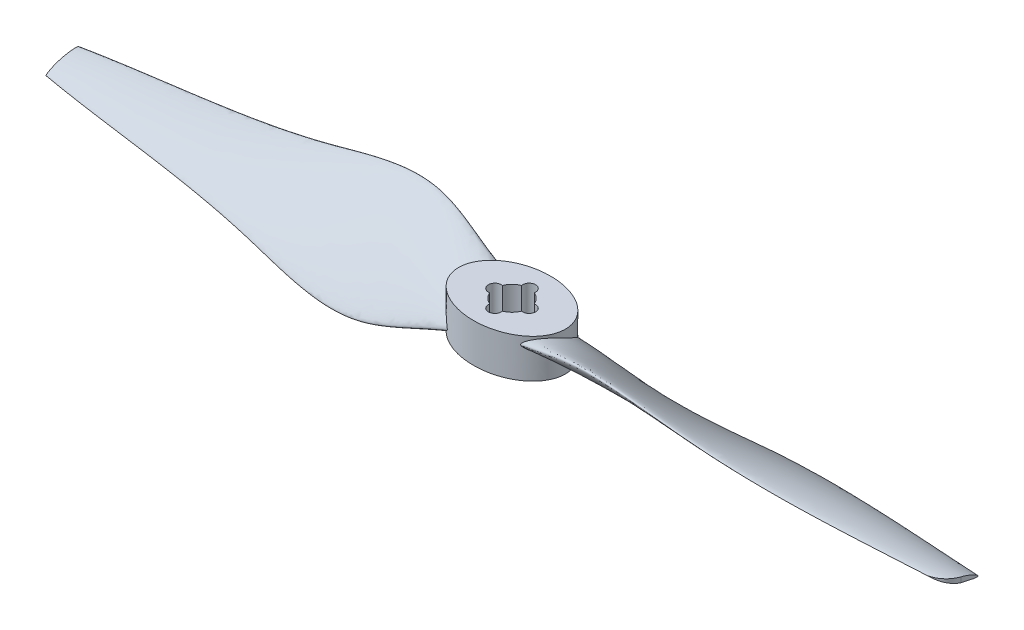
ISO-10303-21;
HEADER;
FILE_DESCRIPTION(('STEP AP214'),'2;1');
FILE_NAME('part.step','',(''),(''),'','','');
FILE_SCHEMA(('AUTOMOTIVE_DESIGN { 1 0 10303 214 1 1 1 1 }'));
ENDSEC;
DATA;
#1=APPLICATION_CONTEXT('core data for automotive mechanical design processes');
#2=APPLICATION_PROTOCOL_DEFINITION('international standard','automotive_design',2000,#1);
#3=PRODUCT_CONTEXT('',#1,'mechanical');
#4=PRODUCT('Part','Part','',(#3));
#5=PRODUCT_RELATED_PRODUCT_CATEGORY('part','',(#4));
#6=PRODUCT_DEFINITION_FORMATION('','',#4);
#7=PRODUCT_DEFINITION_CONTEXT('part definition',#1,'design');
#8=PRODUCT_DEFINITION('design','',#6,#7);
#9=PRODUCT_DEFINITION_SHAPE('','',#8);
#10=(LENGTH_UNIT() NAMED_UNIT(*) SI_UNIT(.MILLI.,.METRE.));
#11=(NAMED_UNIT(*) PLANE_ANGLE_UNIT() SI_UNIT($,.RADIAN.));
#12=(NAMED_UNIT(*) SI_UNIT($,.STERADIAN.) SOLID_ANGLE_UNIT());
#13=UNCERTAINTY_MEASURE_WITH_UNIT(LENGTH_MEASURE(1.E-05),#10,'distance_accuracy_value','');
#14=(GEOMETRIC_REPRESENTATION_CONTEXT(3) GLOBAL_UNCERTAINTY_ASSIGNED_CONTEXT((#13)) GLOBAL_UNIT_ASSIGNED_CONTEXT((#10,
#11,#12)) REPRESENTATION_CONTEXT('',''));
#15=CARTESIAN_POINT('',(0.,0.,0.));
#16=DIRECTION('',(0.,0.,1.));
#17=DIRECTION('',(1.,0.,0.));
#18=AXIS2_PLACEMENT_3D('',#15,#16,#17);
#19=CARTESIAN_POINT('',(0.,0.,0.));
#20=DIRECTION('',(0.,1.,0.));
#21=DIRECTION('',(0.,0.,1.));
#22=AXIS2_PLACEMENT_3D('',#19,#20,#21);
#23=CYLINDRICAL_SURFACE('',#22,2.44475);
#24=CARTESIAN_POINT('',(0.,5.5499,0.));
#25=DIRECTION('',(0.,1.,0.));
#26=DIRECTION('',(0.,0.,1.));
#27=AXIS2_PLACEMENT_3D('',#24,#25,#26);
#28=CIRCLE('',#27,2.44475);
#29=CARTESIAN_POINT('',(-0.904277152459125,5.5499,-2.27136201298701));
#30=VERTEX_POINT('',#29);
#31=CARTESIAN_POINT('',(-2.27136201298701,5.5499,-0.904277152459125));
#32=VERTEX_POINT('',#31);
#33=EDGE_CURVE('E263',#30,#32,#28,.T.);
#34=ORIENTED_EDGE('',*,*,#33,.T.);
#35=DIRECTION('',(0.,1.,0.));
#36=VECTOR('',#35,1.);
#37=CARTESIAN_POINT('',(-2.27136201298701,-3.83241818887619,-0.904277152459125));
#38=LINE('',#37,#36);
#39=CARTESIAN_POINT('',(-2.27136201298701,0.,-0.904277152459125));
#40=VERTEX_POINT('',#39);
#41=EDGE_CURVE('E243',#40,#32,#38,.T.);
#42=ORIENTED_EDGE('',*,*,#41,.F.);
#43=CARTESIAN_POINT('',(0.,0.,0.));
#44=DIRECTION('',(0.,1.,0.));
#45=DIRECTION('',(0.,0.,1.));
#46=AXIS2_PLACEMENT_3D('',#43,#44,#45);
#47=CIRCLE('',#46,2.44475);
#48=CARTESIAN_POINT('',(-0.904277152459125,0.,-2.27136201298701));
#49=VERTEX_POINT('',#48);
#50=EDGE_CURVE('E546',#49,#40,#47,.T.);
#51=ORIENTED_EDGE('',*,*,#50,.F.);
#52=DIRECTION('',(0.,1.,0.));
#53=VECTOR('',#52,1.);
#54=CARTESIAN_POINT('',(-0.904277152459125,-3.83241818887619,-2.27136201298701));
#55=LINE('',#54,#53);
#56=EDGE_CURVE('E270',#49,#30,#55,.T.);
#57=ORIENTED_EDGE('',*,*,#56,.T.);
#58=EDGE_LOOP('',(#34,#42,#51,#57));
#59=FACE_BOUND('',#58,.T.);
#60=ADVANCED_FACE('F167',(#59),#23,.F.);
#61=CARTESIAN_POINT('',(2.27136201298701,5.5499,-0.904277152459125));
#62=VERTEX_POINT('',#61);
#63=CARTESIAN_POINT('',(0.904277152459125,5.5499,-2.27136201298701));
#64=VERTEX_POINT('',#63);
#65=EDGE_CURVE('E273',#62,#64,#28,.T.);
#66=ORIENTED_EDGE('',*,*,#65,.T.);
#67=DIRECTION('',(0.,1.,0.));
#68=VECTOR('',#67,1.);
#69=CARTESIAN_POINT('',(0.904277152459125,-3.83241818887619,-2.27136201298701));
#70=LINE('',#69,#68);
#71=CARTESIAN_POINT('',(0.904277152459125,0.,-2.27136201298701));
#72=VERTEX_POINT('',#71);
#73=EDGE_CURVE('E350',#72,#64,#70,.T.);
#74=ORIENTED_EDGE('',*,*,#73,.F.);
#75=CARTESIAN_POINT('',(2.27136201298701,0.,-0.904277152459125));
#76=VERTEX_POINT('',#75);
#77=EDGE_CURVE('E548',#76,#72,#47,.T.);
#78=ORIENTED_EDGE('',*,*,#77,.F.);
#79=DIRECTION('',(0.,1.,0.));
#80=VECTOR('',#79,1.);
#81=CARTESIAN_POINT('',(2.27136201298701,-3.83241818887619,-0.904277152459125));
#82=LINE('',#81,#80);
#83=EDGE_CURVE('E351',#76,#62,#82,.T.);
#84=ORIENTED_EDGE('',*,*,#83,.T.);
#85=EDGE_LOOP('',(#66,#74,#78,#84));
#86=FACE_BOUND('',#85,.T.);
#87=ADVANCED_FACE('F338',(#86),#23,.F.);
#88=CARTESIAN_POINT('',(0.904277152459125,5.5499,2.27136201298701));
#89=VERTEX_POINT('',#88);
#90=CARTESIAN_POINT('',(2.27136201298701,5.5499,0.904277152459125));
#91=VERTEX_POINT('',#90);
#92=EDGE_CURVE('E278',#89,#91,#28,.T.);
#93=ORIENTED_EDGE('',*,*,#92,.T.);
#94=DIRECTION('',(0.,1.,0.));
#95=VECTOR('',#94,1.);
#96=CARTESIAN_POINT('',(2.27136201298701,-3.83241818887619,0.904277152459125));
#97=LINE('',#96,#95);
#98=CARTESIAN_POINT('',(2.27136201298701,0.,0.904277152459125));
#99=VERTEX_POINT('',#98);
#100=EDGE_CURVE('E369',#99,#91,#97,.T.);
#101=ORIENTED_EDGE('',*,*,#100,.F.);
#102=CARTESIAN_POINT('',(0.904277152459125,0.,2.27136201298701));
#103=VERTEX_POINT('',#102);
#104=EDGE_CURVE('E284',#103,#99,#47,.T.);
#105=ORIENTED_EDGE('',*,*,#104,.F.);
#106=DIRECTION('',(0.,1.,0.));
#107=VECTOR('',#106,1.);
#108=CARTESIAN_POINT('',(0.904277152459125,-3.83241818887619,2.27136201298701));
#109=LINE('',#108,#107);
#110=EDGE_CURVE('E372',#103,#89,#109,.T.);
#111=ORIENTED_EDGE('',*,*,#110,.T.);
#112=EDGE_LOOP('',(#93,#101,#105,#111));
#113=FACE_BOUND('',#112,.T.);
#114=ADVANCED_FACE('F319',(#113),#23,.F.);
#115=CARTESIAN_POINT('',(64.135,2.15907179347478,-2.33275536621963));
#116=DIRECTION('',(1.,0.,0.));
#117=DIRECTION('',(0.,0.,-1.));
#118=AXIS2_PLACEMENT_3D('',#115,#116,#117);
#119=PLANE('',#118);
#120=CARTESIAN_POINT('',(64.135,3.39948035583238,2.33077901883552));
#121=CARTESIAN_POINT('',(64.135,3.05592425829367,2.39527730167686));
#122=CARTESIAN_POINT('',(64.135,1.19260921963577,-4.55870909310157));
#123=CARTESIAN_POINT('',(64.135,3.46249242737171,-0.184226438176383));
#124=CARTESIAN_POINT('',(64.135,3.57414860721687,2.29798727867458));
#125=CARTESIAN_POINT('',(64.135,3.39948035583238,2.33077901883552));
#126=B_SPLINE_CURVE_WITH_KNOTS('',3,(#120,#121,#122,#123,#124,#125),.UNSPECIFIED.,.T.,.F.,(4,1,
1,4),(0.,0.495828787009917,0.747914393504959,1.),.UNSPECIFIED.);
#127=CARTESIAN_POINT('',(64.135,2.52443790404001,0.0752903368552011));
#128=VERTEX_POINT('',#127);
#129=CARTESIAN_POINT('',(64.135,3.25296863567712,0.0752903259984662));
#130=VERTEX_POINT('',#129);
#131=EDGE_CURVE('E173',#128,#130,#126,.T.);
#132=ORIENTED_EDGE('',*,*,#131,.T.);
#133=DIRECTION('',(0.,1.,0.));
#134=VECTOR('',#133,1.);
#135=CARTESIAN_POINT('',(64.135,-3.83228874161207,0.0752903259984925));
#136=LINE('',#135,#134);
#137=EDGE_CURVE('E12',#130,#128,#136,.F.);
#138=ORIENTED_EDGE('',*,*,#137,.T.);
#139=EDGE_LOOP('',(#132,#138));
#140=FACE_BOUND('',#139,.T.);
#141=ADVANCED_FACE('F310',(#140),#119,.T.);
#142=CARTESIAN_POINT('',(0.,5.5499,0.));
#143=DIRECTION('',(0.,1.,0.));
#144=DIRECTION('',(-1.,0.,0.));
#145=AXIS2_PLACEMENT_3D('',#142,#143,#144);
#146=ELLIPSE('',#145,7.62,5.49275);
#147=DIRECTION('',(0.,-1.,0.));
#148=VECTOR('',#147,1.);
#149=SURFACE_OF_LINEAR_EXTRUSION('',#146,#148);
#150=CARTESIAN_POINT('',(-7.62,1.67677953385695,0.));
#151=CARTESIAN_POINT('',(-7.61999998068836,1.68587550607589,-0.0159583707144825));
#152=CARTESIAN_POINT('',(-7.6199035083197,1.694988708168,-0.0319064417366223));
#153=CARTESIAN_POINT('',(-7.6189404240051,1.74064458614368,-0.111608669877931));
#154=CARTESIAN_POINT('',(-7.61663148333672,1.77743387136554,-0.175208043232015));
#155=CARTESIAN_POINT('',(-7.60513088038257,1.88864222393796,-0.365849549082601));
#156=CARTESIAN_POINT('',(-7.59134999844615,1.96365327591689,-0.492294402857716));
#157=CARTESIAN_POINT('',(-7.55197017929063,2.11425934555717,-0.743142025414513));
#158=CARTESIAN_POINT('',(-7.5263578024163,2.18985493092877,-0.867542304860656));
#159=CARTESIAN_POINT('',(-7.46340785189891,2.34143748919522,-1.11501526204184));
#160=CARTESIAN_POINT('',(-7.42594774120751,2.41741999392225,-1.23805948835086));
#161=CARTESIAN_POINT('',(-7.33985879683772,2.56811667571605,-1.48097862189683));
#162=CARTESIAN_POINT('',(-7.29122919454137,2.64283076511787,-1.6008533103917));
#163=CARTESIAN_POINT('',(-7.18325906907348,2.7903265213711,-1.83705995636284));
#164=CARTESIAN_POINT('',(-7.12391000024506,2.86310659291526,-1.95338900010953));
#165=CARTESIAN_POINT('',(-6.99511037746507,3.00608621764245,-2.18188699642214));
#166=CARTESIAN_POINT('',(-6.92566314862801,3.07628661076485,-2.29405730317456));
#167=CARTESIAN_POINT('',(-6.77095604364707,3.21964564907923,-2.52316065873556));
#168=CARTESIAN_POINT('',(-6.68485355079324,3.29254787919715,-2.63968704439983));
#169=CARTESIAN_POINT('',(-6.54819601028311,3.39927454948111,-2.80975024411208));
#170=CARTESIAN_POINT('',(-6.50144866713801,3.43437497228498,-2.86559112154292));
#171=CARTESIAN_POINT('',(-6.40556963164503,3.5038284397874,-2.97567140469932));
#172=CARTESIAN_POINT('',(-6.35643798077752,3.53818149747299,-3.02991083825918));
#173=CARTESIAN_POINT('',(-6.25610444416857,3.60619792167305,-3.13653810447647));
#174=CARTESIAN_POINT('',(-6.20490867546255,3.63986293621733,-3.18893065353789));
#175=CARTESIAN_POINT('',(-6.10052378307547,3.70688851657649,-3.29191552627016));
#176=CARTESIAN_POINT('',(-6.04733426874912,3.74024902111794,-3.34250749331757));
#177=CARTESIAN_POINT('',(-5.93893087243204,3.8073325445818,-3.44202578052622));
#178=CARTESIAN_POINT('',(-5.88370681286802,3.84105653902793,-3.49094037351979));
#179=CARTESIAN_POINT('',(-5.79994671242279,3.89243873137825,-3.56261602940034));
#180=CARTESIAN_POINT('',(-5.77188109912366,3.90969361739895,-3.58621849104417));
#181=CARTESIAN_POINT('',(-5.71553077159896,3.94466455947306,-3.63281014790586));
#182=CARTESIAN_POINT('',(-5.68724606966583,3.96238058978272,-3.65579937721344));
#183=CARTESIAN_POINT('',(-5.63042436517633,3.99864397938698,-3.70121984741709));
#184=CARTESIAN_POINT('',(-5.60188684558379,4.01719552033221,-3.72364713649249));
#185=CARTESIAN_POINT('',(-5.54489795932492,4.05548514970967,-3.76770803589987));
#186=CARTESIAN_POINT('',(-5.5164468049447,4.07522509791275,-3.7893403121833));
#187=CARTESIAN_POINT('',(-5.46031692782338,4.11635211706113,-3.83134631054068));
#188=CARTESIAN_POINT('',(-5.43263346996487,4.13772206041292,-3.85172990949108));
#189=CARTESIAN_POINT('',(-5.3921722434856,4.17200299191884,-3.88108652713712));
#190=CARTESIAN_POINT('',(-5.37887848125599,4.1837848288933,-3.89065770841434));
#191=CARTESIAN_POINT('',(-5.35285134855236,4.20834067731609,-3.90926442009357));
#192=CARTESIAN_POINT('',(-5.34011754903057,4.22111390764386,-3.91830036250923));
#193=CARTESIAN_POINT('',(-5.31815394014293,4.24514098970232,-3.93378388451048));
#194=CARTESIAN_POINT('',(-5.30875316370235,4.25614375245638,-3.940374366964));
#195=CARTESIAN_POINT('',(-5.29078122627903,4.2792157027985,-3.95291424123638));
#196=CARTESIAN_POINT('',(-5.28221202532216,4.29128728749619,-3.95886212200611));
#197=CARTESIAN_POINT('',(-5.26627942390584,4.31688834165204,-3.96987623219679));
#198=CARTESIAN_POINT('',(-5.25893561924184,4.33043664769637,-3.97492820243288));
#199=CARTESIAN_POINT('',(-5.24642120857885,4.3589448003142,-3.98351179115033));
#200=CARTESIAN_POINT('',(-5.24124060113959,4.37389775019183,-3.98705040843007));
#201=CARTESIAN_POINT('',(-5.23528009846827,4.39935776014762,-3.99111641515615));
#202=CARTESIAN_POINT('',(-5.23358983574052,4.40955000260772,-3.99226752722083));
#203=CARTESIAN_POINT('',(-5.23167091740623,4.43013167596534,-3.99357418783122));
#204=CARTESIAN_POINT('',(-5.2314409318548,4.44052091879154,-3.9937306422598));
#205=CARTESIAN_POINT('',(-5.23246727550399,4.46118581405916,-3.99303194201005));
#206=CARTESIAN_POINT('',(-5.23372302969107,4.47146150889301,-3.99217717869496));
#207=CARTESIAN_POINT('',(-5.23760315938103,4.49162582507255,-3.98953216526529));
#208=CARTESIAN_POINT('',(-5.24022914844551,4.50151397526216,-3.98774081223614));
#209=CARTESIAN_POINT('',(-5.2482659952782,4.52601337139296,-3.98224689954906));
#210=CARTESIAN_POINT('',(-5.25441462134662,4.54026161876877,-3.97803480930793));
#211=CARTESIAN_POINT('',(-5.26835963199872,4.5675062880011,-3.96843990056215));
#212=CARTESIAN_POINT('',(-5.27616185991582,4.5804980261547,-3.96305292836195));
#213=CARTESIAN_POINT('',(-5.2950466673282,4.60870067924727,-3.94994926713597));
#214=CARTESIAN_POINT('',(-5.30644951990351,4.62358132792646,-3.94199418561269));
#215=CARTESIAN_POINT('',(-5.33030598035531,4.65197498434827,-3.92523485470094));
#216=CARTESIAN_POINT('',(-5.34276151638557,4.6654853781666,-3.91642904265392));
#217=CARTESIAN_POINT('',(-5.36840892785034,4.69145997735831,-3.89816324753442));
#218=CARTESIAN_POINT('',(-5.38160401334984,4.7039189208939,-3.88870036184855));
#219=CARTESIAN_POINT('',(-5.40844685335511,4.72791018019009,-3.86930174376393));
#220=CARTESIAN_POINT('',(-5.42209423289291,4.7394432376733,-3.85936640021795));
#221=CARTESIAN_POINT('',(-5.45641905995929,4.76715599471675,-3.83417928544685));
#222=CARTESIAN_POINT('',(-5.47729318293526,4.7828736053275,-3.81868796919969));
#223=CARTESIAN_POINT('',(-5.51948389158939,4.8129432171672,-3.78699167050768));
#224=CARTESIAN_POINT('',(-5.54080066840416,4.82729461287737,-3.77078637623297));
#225=CARTESIAN_POINT('',(-5.6052125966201,4.868666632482,-3.72119932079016));
#226=CARTESIAN_POINT('',(-5.64870827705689,4.89395815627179,-3.68689100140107));
#227=CARTESIAN_POINT('',(-5.73594674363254,4.9409077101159,-3.61622970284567));
#228=CARTESIAN_POINT('',(-5.77968949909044,4.96256618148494,-3.5798769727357));
#229=CARTESIAN_POINT('',(-5.86696811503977,5.00272743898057,-3.50533046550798));
#230=CARTESIAN_POINT('',(-5.91050412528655,5.02123302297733,-3.46713835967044));
#231=CARTESIAN_POINT('',(-6.0217270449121,5.06511528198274,-3.3667647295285));
#232=CARTESIAN_POINT('',(-6.08907527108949,5.08841844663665,-3.30328705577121));
#233=CARTESIAN_POINT('',(-6.22161262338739,5.12853988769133,-3.17237099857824));
#234=CARTESIAN_POINT('',(-6.28680400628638,5.14536515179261,-3.10493697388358));
#235=CARTESIAN_POINT('',(-6.47989297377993,5.1868823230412,-2.89501584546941));
#236=CARTESIAN_POINT('',(-6.60352643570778,5.20194312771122,-2.74648843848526));
#237=CARTESIAN_POINT('',(-6.83393285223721,5.2075574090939,-2.43611215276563));
#238=CARTESIAN_POINT('',(-6.94067332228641,5.19806426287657,-2.27423849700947));
#239=CARTESIAN_POINT('',(-7.13318784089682,5.15613585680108,-1.94026590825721));
#240=CARTESIAN_POINT('',(-7.21886266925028,5.12359472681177,-1.76812315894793));
#241=CARTESIAN_POINT('',(-7.36579330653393,5.03850194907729,-1.41869480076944));
#242=CARTESIAN_POINT('',(-7.4270752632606,4.98597184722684,-1.24141491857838));
#243=CARTESIAN_POINT('',(-7.50064225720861,4.89441645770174,-0.972820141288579));
#244=CARTESIAN_POINT('',(-7.52223292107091,4.86134858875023,-0.88186022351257));
#245=CARTESIAN_POINT('',(-7.55891672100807,4.79150425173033,-0.700122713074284));
#246=CARTESIAN_POINT('',(-7.57401512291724,4.75473081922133,-0.609345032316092));
#247=CARTESIAN_POINT('',(-7.59783649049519,4.67795560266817,-0.428384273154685));
#248=CARTESIAN_POINT('',(-7.60656240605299,4.63795532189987,-0.338200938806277));
#249=CARTESIAN_POINT('',(-7.61783926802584,4.55512366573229,-0.158700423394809));
#250=CARTESIAN_POINT('',(-7.62038655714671,4.51229062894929,-0.0693837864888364));
#251=CARTESIAN_POINT('',(-7.61934553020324,4.40655160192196,0.143538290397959));
#252=CARTESIAN_POINT('',(-7.61289265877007,4.34247449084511,0.266556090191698));
#253=CARTESIAN_POINT('',(-7.58903813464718,4.2103817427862,0.509437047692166));
#254=CARTESIAN_POINT('',(-7.57162905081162,4.14236346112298,0.629298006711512));
#255=CARTESIAN_POINT('',(-7.52661906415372,4.0032201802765,0.865541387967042));
#256=CARTESIAN_POINT('',(-7.49899877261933,3.93208949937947,0.981916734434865));
#257=CARTESIAN_POINT('',(-7.43442705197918,3.78747231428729,1.21045884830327));
#258=CARTESIAN_POINT('',(-7.39747827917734,3.71398648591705,1.32262680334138));
#259=CARTESIAN_POINT('',(-7.30044058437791,3.53910456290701,1.58152693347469));
#260=CARTESIAN_POINT('',(-7.23678846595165,3.43702227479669,1.72646613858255));
#261=CARTESIAN_POINT('',(-7.09554615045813,3.23161549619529,2.00810343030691));
#262=CARTESIAN_POINT('',(-7.01797032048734,3.12829238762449,2.14480981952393));
#263=CARTESIAN_POINT('',(-6.85041447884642,2.92113562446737,2.40989314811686));
#264=CARTESIAN_POINT('',(-6.76043817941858,2.81730213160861,2.53827256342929));
#265=CARTESIAN_POINT('',(-6.6174402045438,2.66138886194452,2.72428745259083));
#266=CARTESIAN_POINT('',(-6.56846024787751,2.60941511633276,2.78517290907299));
#267=CARTESIAN_POINT('',(-6.4680258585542,2.5053305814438,2.90473814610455));
#268=CARTESIAN_POINT('',(-6.41657166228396,2.45321980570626,2.96341813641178));
#269=CARTESIAN_POINT('',(-6.31165673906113,2.34895466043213,3.07825761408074));
#270=CARTESIAN_POINT('',(-6.2582054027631,2.29680140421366,3.13442669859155));
#271=CARTESIAN_POINT('',(-6.17649705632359,2.21808643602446,3.21700875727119));
#272=CARTESIAN_POINT('',(-6.14894984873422,2.19171475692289,3.24430971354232));
#273=CARTESIAN_POINT('',(-6.09343725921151,2.13880331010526,3.29828263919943));
#274=CARTESIAN_POINT('',(-6.06547206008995,2.11226361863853,3.32495487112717));
#275=CARTESIAN_POINT('',(-5.9994654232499,2.04975296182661,3.38674035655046));
#276=CARTESIAN_POINT('',(-5.96127333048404,2.01368429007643,3.42159424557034));
#277=CARTESIAN_POINT('',(-5.88437622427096,1.9408714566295,3.49007310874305));
#278=CARTESIAN_POINT('',(-5.84567094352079,1.90412693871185,3.52369740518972));
#279=CARTESIAN_POINT('',(-5.76792443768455,1.82953974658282,3.58965314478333));
#280=CARTESIAN_POINT('',(-5.72888257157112,1.79169425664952,3.62198065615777));
#281=CARTESIAN_POINT('',(-5.65131246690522,1.71480519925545,3.68475101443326));
#282=CARTESIAN_POINT('',(-5.61278268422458,1.67577456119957,3.71520755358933));
#283=CARTESIAN_POINT('',(-5.55572098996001,1.61550040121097,3.75934756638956));
#284=CARTESIAN_POINT('',(-5.53684160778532,1.59514277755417,3.77378939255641));
#285=CARTESIAN_POINT('',(-5.49947104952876,1.55367343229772,3.80207645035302));
#286=CARTESIAN_POINT('',(-5.48097980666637,1.53256184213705,3.81592178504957));
#287=CARTESIAN_POINT('',(-5.44467800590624,1.48944778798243,3.84282981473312));
#288=CARTESIAN_POINT('',(-5.42686508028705,1.4674491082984,3.85589534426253));
#289=CARTESIAN_POINT('',(-5.39219909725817,1.42219957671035,3.88108287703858));
#290=CARTESIAN_POINT('',(-5.37534531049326,1.3989497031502,3.89320559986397));
#291=CARTESIAN_POINT('',(-5.35189453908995,1.36383537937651,3.90993004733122));
#292=CARTESIAN_POINT('',(-5.34468741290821,1.35262657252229,3.9150483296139));
#293=CARTESIAN_POINT('',(-5.33068538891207,1.32980956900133,3.92495502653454));
#294=CARTESIAN_POINT('',(-5.32389064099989,1.31820122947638,3.92974332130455));
#295=CARTESIAN_POINT('',(-5.30429361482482,1.28272946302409,3.94350506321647));
#296=CARTESIAN_POINT('',(-5.29225237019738,1.25818145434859,3.95189398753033));
#297=CARTESIAN_POINT('',(-5.27454324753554,1.21446441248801,3.96417041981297));
#298=CARTESIAN_POINT('',(-5.26804045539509,1.19580984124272,3.96865741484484));
#299=CARTESIAN_POINT('',(-5.25741801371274,1.1575047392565,3.9759699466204));
#300=CARTESIAN_POINT('',(-5.25329436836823,1.13785593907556,3.97879826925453));
#301=CARTESIAN_POINT('',(-5.2487369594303,1.10216763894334,3.98192196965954));
#302=CARTESIAN_POINT('',(-5.24770726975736,1.08624364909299,3.98262653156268));
#303=CARTESIAN_POINT('',(-5.24789699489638,1.05441979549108,3.98249670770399));
#304=CARTESIAN_POINT('',(-5.24911373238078,1.03851992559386,3.98166415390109));
#305=CARTESIAN_POINT('',(-5.25383312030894,1.00721526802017,3.97842844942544));
#306=CARTESIAN_POINT('',(-5.25733765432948,0.991810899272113,3.97602400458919));
#307=CARTESIAN_POINT('',(-5.26638996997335,0.961916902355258,3.96979467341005));
#308=CARTESIAN_POINT('',(-5.27194041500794,0.947428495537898,3.96596793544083));
#309=CARTESIAN_POINT('',(-5.29563703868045,0.89575592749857,3.94956001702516));
#310=CARTESIAN_POINT('',(-5.31908018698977,0.862176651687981,3.93320642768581));
#311=CARTESIAN_POINT('',(-5.35648845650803,0.819991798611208,3.90667087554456));
#312=CARTESIAN_POINT('',(-5.36839443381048,0.807942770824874,3.89817219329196));
#313=CARTESIAN_POINT('',(-5.39294737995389,0.785142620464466,3.88052204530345));
#314=CARTESIAN_POINT('',(-5.40559325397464,0.7743896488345,3.87137153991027));
#315=CARTESIAN_POINT('',(-5.44435456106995,0.743697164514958,3.84311366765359));
#316=CARTESIAN_POINT('',(-5.47121067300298,0.725410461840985,3.82325854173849));
#317=CARTESIAN_POINT('',(-5.5297224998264,0.689699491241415,3.779298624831));
#318=CARTESIAN_POINT('',(-5.56151738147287,0.672768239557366,3.75499115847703));
#319=CARTESIAN_POINT('',(-5.62562087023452,0.642109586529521,3.70504314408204));
#320=CARTESIAN_POINT('',(-5.65792994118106,0.628385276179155,3.67940133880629));
#321=CARTESIAN_POINT('',(-5.75503509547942,0.591164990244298,3.60080726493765));
#322=CARTESIAN_POINT('',(-5.82000793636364,0.571622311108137,3.54618722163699));
#323=CARTESIAN_POINT('',(-5.94292089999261,0.542259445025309,3.43850484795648));
#324=CARTESIAN_POINT('',(-6.00096739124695,0.531722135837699,3.3857452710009));
#325=CARTESIAN_POINT('',(-6.11533382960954,0.516612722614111,3.27768908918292));
#326=CARTESIAN_POINT('',(-6.17165543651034,0.512034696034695,3.22239505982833));
#327=CARTESIAN_POINT('',(-6.28255624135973,0.50803385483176,3.10905846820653));
#328=CARTESIAN_POINT('',(-6.33711799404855,0.50865237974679,3.05099752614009));
#329=CARTESIAN_POINT('',(-6.44365335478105,0.514598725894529,2.93276513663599));
#330=CARTESIAN_POINT('',(-6.49562602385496,0.519928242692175,2.87259293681));
#331=CARTESIAN_POINT('',(-6.6473267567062,0.542394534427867,2.68905151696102));
#332=CARTESIAN_POINT('',(-6.7426962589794,0.566011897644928,2.56280121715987));
#333=CARTESIAN_POINT('',(-6.93718833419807,0.634049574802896,2.27913357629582));
#334=CARTESIAN_POINT('',(-7.03336272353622,0.681646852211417,2.12046848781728));
#335=CARTESIAN_POINT('',(-7.20431194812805,0.793732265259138,1.79772451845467));
#336=CARTESIAN_POINT('',(-7.27907792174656,0.858227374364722,1.63364342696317));
#337=CARTESIAN_POINT('',(-7.41636886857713,1.01120339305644,1.27684650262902));
#338=CARTESIAN_POINT('',(-7.47518898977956,1.10185386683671,1.08364140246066));
#339=CARTESIAN_POINT('',(-7.56335145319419,1.29487257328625,0.696671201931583));
#340=CARTESIAN_POINT('',(-7.59271699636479,1.397231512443,0.502906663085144));
#341=CARTESIAN_POINT('',(-7.61598262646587,1.56008705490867,0.206418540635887));
#342=CARTESIAN_POINT('',(-7.62000012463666,1.61807445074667,0.102994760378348));
#343=CARTESIAN_POINT('',(-7.62,1.67677953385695,0.));
#344=B_SPLINE_CURVE_WITH_KNOTS('',3,(#150,#151,#152,#153,#154,#155,#156,#157,#158,#159,#160,
#161,#162,#163,#164,#165,#166,#167,#168,#169,#170,#171,#172,#173,#174,#175,#176,#177,#178,#179,
#180,#181,#182,#183,#184,#185,#186,#187,#188,#189,#190,#191,#192,#193,#194,#195,#196,#197,#198,
#199,#200,#201,#202,#203,#204,#205,#206,#207,#208,#209,#210,#211,#212,#213,#214,#215,#216,#217,
#218,#219,#220,#221,#222,#223,#224,#225,#226,#227,#228,#229,#230,#231,#232,#233,#234,#235,#236,
#237,#238,#239,#240,#241,#242,#243,#244,#245,#246,#247,#248,#249,#250,#251,#252,#253,#254,#255,
#256,#257,#258,#259,#260,#261,#262,#263,#264,#265,#266,#267,#268,#269,#270,#271,#272,#273,#274,
#275,#276,#277,#278,#279,#280,#281,#282,#283,#284,#285,#286,#287,#288,#289,#290,#291,#292,#293,
#294,#295,#296,#297,#298,#299,#300,#301,#302,#303,#304,#305,#306,#307,#308,#309,#310,#311,#312,
#313,#314,#315,#316,#317,#318,#319,#320,#321,#322,#323,#324,#325,#326,#327,#328,#329,#330,#331,
#332,#333,#334,#335,#336,#337,#338,#339,#340,#341,#342,#343),.UNSPECIFIED.,.T.,.F.,(4,2,2,2,2,2,
2,2,2,2,2,2,2,2,2,2,2,2,2,2,2,2,2,2,2,2,2,2,2,2,2,2,2,2,2,2,2,2,2,2,2,2,2,2,2,2,2,2,2,2,2,2,2,2,
2,2,2,2,2,2,2,2,2,2,2,2,2,2,2,2,2,2,2,2,2,2,2,2,2,2,2,2,2,2,2,2,2,2,2,2,2,2,2,2,2,2,4),(0.,
0.0551050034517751,0.275571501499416,0.718017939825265,1.1609682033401,1.60865842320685,
2.05637945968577,2.50445901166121,2.95239135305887,3.43843129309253,3.68091576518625,
3.92339602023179,4.16520403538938,4.40705967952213,4.65035708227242,4.77193401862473,
4.8935041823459,5.01577090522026,5.13823420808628,5.25955240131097,5.32006012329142,
5.38052064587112,5.4281772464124,5.47594357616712,5.52441268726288,5.57265515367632,
5.60370404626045,5.63472465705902,5.66573326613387,5.69677847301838,5.74474361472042,
5.7928811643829,5.85383687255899,5.91490675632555,5.97626607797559,6.03757574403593,
6.12864726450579,6.21975896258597,6.40224836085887,6.58471557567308,6.76702001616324,
7.052949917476,7.33857051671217,7.91713847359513,8.49680581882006,9.07915326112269,
9.66087476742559,9.95813104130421,10.2551457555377,10.5520228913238,10.8490757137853,
11.265049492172,11.6813057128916,12.0983564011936,12.5152884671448,13.0795562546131,
13.6432451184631,14.2067655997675,14.4882608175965,14.769729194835,15.0500089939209,
15.1907051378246,15.3313414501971,15.5204528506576,15.7096669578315,15.8994170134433,
16.0875530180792,16.1814283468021,16.2752873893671,16.3687813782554,16.4622032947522,
16.5050137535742,16.5478396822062,16.6333431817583,16.6939556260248,16.7544659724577,
16.8021791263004,16.8498354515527,16.8975310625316,16.945288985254,17.0748001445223,
17.1316688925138,17.188455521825,17.3024245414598,17.4326113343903,17.5629230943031,
17.82355141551,18.0607066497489,18.2976260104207,18.536431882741,18.7753237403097,
19.2537067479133,19.8261378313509,20.3988055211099,21.0604183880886,21.7215097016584,
22.0771554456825),.UNSPECIFIED.);
#345=CARTESIAN_POINT('',(-7.62,1.67677953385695,0.));
#346=VERTEX_POINT('',#345);
#347=EDGE_CURVE('E427',#346,#346,#344,.T.);
#348=ORIENTED_EDGE('',*,*,#347,.T.);
#349=EDGE_LOOP('',(#348));
#350=FACE_BOUND('',#349,.T.);
#351=CARTESIAN_POINT('',(5.23321655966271,4.46585173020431,3.99252166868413));
#352=CARTESIAN_POINT('',(5.23431564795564,4.47505778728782,3.99177309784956));
#353=CARTESIAN_POINT('',(5.23600256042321,4.48415849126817,3.99062384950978));
#354=CARTESIAN_POINT('',(5.24039165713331,4.50200005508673,3.98762917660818));
#355=CARTESIAN_POINT('',(5.24309569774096,4.5107402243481,3.98578247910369));
#356=CARTESIAN_POINT('',(5.25168002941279,4.53432435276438,3.97990832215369));
#357=CARTESIAN_POINT('',(5.25840602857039,4.54871028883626,3.97529442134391));
#358=CARTESIAN_POINT('',(5.27345370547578,4.5762067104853,3.96492378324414));
#359=CARTESIAN_POINT('',(5.28178293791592,4.58931069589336,3.95916163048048));
#360=CARTESIAN_POINT('',(5.30250374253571,4.61873122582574,3.94475179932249));
#361=CARTESIAN_POINT('',(5.31530656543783,4.63460031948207,3.9357937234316));
#362=CARTESIAN_POINT('',(5.34197406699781,4.66476528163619,3.91698887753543));
#363=CARTESIAN_POINT('',(5.35583764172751,4.67906274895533,3.90714302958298));
#364=CARTESIAN_POINT('',(5.38434318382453,4.70652589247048,3.8867327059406));
#365=CARTESIAN_POINT('',(5.39898940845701,4.71968407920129,3.87616418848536));
#366=CARTESIAN_POINT('',(5.42874914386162,4.74499570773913,3.85450624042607));
#367=CARTESIAN_POINT('',(5.44386266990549,4.75714911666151,3.84341679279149));
#368=CARTESIAN_POINT('',(5.48159024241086,4.78613051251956,3.81549024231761));
#369=CARTESIAN_POINT('',(5.50439139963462,4.802471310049,3.79840109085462));
#370=CARTESIAN_POINT('',(5.55040775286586,4.83368151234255,3.76344689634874));
#371=CARTESIAN_POINT('',(5.57362311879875,4.84855029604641,3.74558153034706));
#372=CARTESIAN_POINT('',(5.64367201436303,4.89132143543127,3.69092684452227));
#373=CARTESIAN_POINT('',(5.69085711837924,4.91735108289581,3.65311667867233));
#374=CARTESIAN_POINT('',(5.78529167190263,4.96540586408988,3.57521398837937));
#375=CARTESIAN_POINT('',(5.83254107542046,4.98743306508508,3.53512265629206));
#376=CARTESIAN_POINT('',(5.92663907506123,5.02797354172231,3.45284559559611));
#377=CARTESIAN_POINT('',(5.97348796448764,5.04648964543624,3.41066158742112));
#378=CARTESIAN_POINT('',(6.0878741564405,5.08808639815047,3.30440894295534));
#379=CARTESIAN_POINT('',(6.15501803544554,5.10935047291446,3.23919714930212));
#380=CARTESIAN_POINT('',(6.28689281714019,5.1454244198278,3.10481005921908));
#381=CARTESIAN_POINT('',(6.35162576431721,5.16023987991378,3.03563825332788));
#382=CARTESIAN_POINT('',(6.47889778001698,5.18379186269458,2.89254294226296));
#383=CARTESIAN_POINT('',(6.54139391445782,5.19244113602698,2.81856680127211));
#384=CARTESIAN_POINT('',(6.66254755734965,5.20345478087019,2.66704257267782));
#385=CARTESIAN_POINT('',(6.72120366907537,5.2058168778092,2.58949320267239));
#386=CARTESIAN_POINT('',(6.83408752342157,5.20440430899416,2.43113454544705));
#387=CARTESIAN_POINT('',(6.88830936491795,5.20062160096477,2.35032112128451));
#388=CARTESIAN_POINT('',(6.99169173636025,5.18711439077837,2.18595866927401));
#389=CARTESIAN_POINT('',(7.04085045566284,5.17738777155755,2.102408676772));
#390=CARTESIAN_POINT('',(7.13345901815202,5.15232362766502,1.93339232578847));
#391=CARTESIAN_POINT('',(7.17692752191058,5.1370051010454,1.84793336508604));
#392=CARTESIAN_POINT('',(7.2580105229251,5.10111141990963,1.67532444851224));
#393=CARTESIAN_POINT('',(7.29562285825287,5.08053433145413,1.58817388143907));
#394=CARTESIAN_POINT('',(7.36471440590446,5.03456556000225,1.41278881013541));
#395=CARTESIAN_POINT('',(7.39619754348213,5.00917697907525,1.32455503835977));
#396=CARTESIAN_POINT('',(7.45294736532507,4.95403794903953,1.14744043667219));
#397=CARTESIAN_POINT('',(7.47821171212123,4.92428586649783,1.05855937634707));
#398=CARTESIAN_POINT('',(7.54639428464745,4.82661217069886,0.784437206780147));
#399=CARTESIAN_POINT('',(7.5789028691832,4.75217559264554,0.598817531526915));
#400=CARTESIAN_POINT('',(7.61761172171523,4.59054883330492,0.230468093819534));
#401=CARTESIAN_POINT('',(7.62379243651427,4.50334922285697,0.0477405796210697));
#402=CARTESIAN_POINT('',(7.61351849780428,4.3458299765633,-0.260387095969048));
#403=CARTESIAN_POINT('',(7.60303654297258,4.27782309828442,-0.387225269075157));
#404=CARTESIAN_POINT('',(7.57054491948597,4.13790969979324,-0.637277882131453));
#405=CARTESIAN_POINT('',(7.54853079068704,4.06600168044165,-0.760490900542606));
#406=CARTESIAN_POINT('',(7.49386438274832,3.91920772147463,-1.00281941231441));
#407=CARTESIAN_POINT('',(7.46120325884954,3.84431935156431,-1.12193140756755));
#408=CARTESIAN_POINT('',(7.3861916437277,3.69228268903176,-1.35551986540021));
#409=CARTESIAN_POINT('',(7.34384322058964,3.61513488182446,-1.46999731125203));
#410=CARTESIAN_POINT('',(7.26557979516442,3.4849271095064,-1.6575545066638));
#411=CARTESIAN_POINT('',(7.23209263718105,3.43224384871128,-1.7319251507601));
#412=CARTESIAN_POINT('',(7.16132817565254,3.32645579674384,-1.87851000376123));
#413=CARTESIAN_POINT('',(7.12405140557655,3.27335106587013,-1.95072451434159));
#414=CARTESIAN_POINT('',(7.00693656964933,3.11374926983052,-2.16396410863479));
#415=CARTESIAN_POINT('',(6.92173694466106,3.00683737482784,-2.30176742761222));
#416=CARTESIAN_POINT('',(6.73885577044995,2.79272520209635,-2.56830370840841));
#417=CARTESIAN_POINT('',(6.64118353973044,2.68552519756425,-2.69704333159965));
#418=CARTESIAN_POINT('',(6.4866782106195,2.52438611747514,-2.88310495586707));
#419=CARTESIAN_POINT('',(6.43384595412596,2.47061880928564,-2.94394849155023));
#420=CARTESIAN_POINT('',(6.32578139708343,2.36281955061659,-3.06321502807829));
#421=CARTESIAN_POINT('',(6.27054930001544,2.30878762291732,-3.12163823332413));
#422=CARTESIAN_POINT('',(6.1630368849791,2.20504843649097,-3.23084676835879));
#423=CARTESIAN_POINT('',(6.11093301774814,2.15538555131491,-3.28184842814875));
#424=CARTESIAN_POINT('',(6.00533157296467,2.05526180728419,-3.38162053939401));
#425=CARTESIAN_POINT('',(5.95183359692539,2.00480072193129,-3.4303903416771));
#426=CARTESIAN_POINT('',(5.84379380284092,1.90235486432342,-3.52558686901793));
#427=CARTESIAN_POINT('',(5.78924946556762,1.85036619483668,-3.57200659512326));
#428=CARTESIAN_POINT('',(5.70745510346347,1.77051119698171,-3.63939285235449));
#429=CARTESIAN_POINT('',(5.68020206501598,1.74358910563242,-3.66147484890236));
#430=CARTESIAN_POINT('',(5.62589161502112,1.68887950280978,-3.70478745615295));
#431=CARTESIAN_POINT('',(5.59883417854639,1.66109210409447,-3.72601817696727));
#432=CARTESIAN_POINT('',(5.54955992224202,1.60894493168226,-3.7640940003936));
#433=CARTESIAN_POINT('',(5.52727210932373,1.58476351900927,-3.78109042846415));
#434=CARTESIAN_POINT('',(5.48327170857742,1.53526088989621,-3.81423311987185));
#435=CARTESIAN_POINT('',(5.46155963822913,1.5099386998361,-3.83037863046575));
#436=CARTESIAN_POINT('',(5.41925521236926,1.45788791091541,-3.86147266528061));
#437=CARTESIAN_POINT('',(5.39865827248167,1.43116612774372,-3.87642623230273));
#438=CARTESIAN_POINT('',(5.35923850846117,1.37568069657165,-3.90474362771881));
#439=CARTESIAN_POINT('',(5.34041251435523,1.34692086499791,-3.91811030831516));
#440=CARTESIAN_POINT('',(5.31068713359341,1.29486007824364,-3.93902987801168));
#441=CARTESIAN_POINT('',(5.29903469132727,1.27224581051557,-3.94716877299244));
#442=CARTESIAN_POINT('',(5.28356222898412,1.2370298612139,-3.95792130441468));
#443=CARTESIAN_POINT('',(5.27874395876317,1.2250914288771,-3.96125952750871));
#444=CARTESIAN_POINT('',(5.26993404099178,1.20074794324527,-3.96734986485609));
#445=CARTESIAN_POINT('',(5.26594333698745,1.18834237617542,-3.97010131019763));
#446=CARTESIAN_POINT('',(5.25797695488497,1.15938993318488,-3.97558484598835));
#447=CARTESIAN_POINT('',(5.2543490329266,1.14269566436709,-3.97807453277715));
#448=CARTESIAN_POINT('',(5.24931781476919,1.10883734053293,-3.9815244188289));
#449=CARTESIAN_POINT('',(5.24790923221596,1.09167450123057,-3.98248825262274));
#450=CARTESIAN_POINT('',(5.24769600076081,1.05714557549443,-3.98263432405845));
#451=CARTESIAN_POINT('',(5.24891563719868,1.03977908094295,-3.98179994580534));
#452=CARTESIAN_POINT('',(5.25407762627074,1.00564888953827,-3.97826083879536));
#453=CARTESIAN_POINT('',(5.25802083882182,0.988885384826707,-3.97555551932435));
#454=CARTESIAN_POINT('',(5.26775006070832,0.958214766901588,-3.96885678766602));
#455=CARTESIAN_POINT('',(5.27329774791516,0.944192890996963,-3.96502939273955));
#456=CARTESIAN_POINT('',(5.28593798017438,0.91724518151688,-3.95627435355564));
#457=CARTESIAN_POINT('',(5.29303094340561,0.904319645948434,-3.95134641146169));
#458=CARTESIAN_POINT('',(5.31388369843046,0.870780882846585,-3.93679097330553));
#459=CARTESIAN_POINT('',(5.3287923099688,0.851253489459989,-3.92631708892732));
#460=CARTESIAN_POINT('',(5.36075068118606,0.815156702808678,-3.90364754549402));
#461=CARTESIAN_POINT('',(5.37780840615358,0.798598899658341,-3.8914454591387));
#462=CARTESIAN_POINT('',(5.41322415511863,0.767828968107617,-3.8658471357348));
#463=CARTESIAN_POINT('',(5.43158726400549,0.753626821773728,-3.85244616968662));
#464=CARTESIAN_POINT('',(5.46905777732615,0.727133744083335,-3.82480235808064));
#465=CARTESIAN_POINT('',(5.48816595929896,0.714844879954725,-3.8105586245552));
#466=CARTESIAN_POINT('',(5.54618541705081,0.680288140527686,-3.76681802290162));
#467=CARTESIAN_POINT('',(5.58574871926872,0.660364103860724,-3.73634257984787));
#468=CARTESIAN_POINT('',(5.66945600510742,0.62322039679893,-3.6703034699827));
#469=CARTESIAN_POINT('',(5.7136509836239,0.606492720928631,-3.63453939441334));
#470=CARTESIAN_POINT('',(5.80185232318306,0.577542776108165,-3.5611965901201));
#471=CARTESIAN_POINT('',(5.84585887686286,0.565312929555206,-3.52362103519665));
#472=CARTESIAN_POINT('',(5.94931162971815,0.540934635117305,-3.43278229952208));
#473=CARTESIAN_POINT('',(6.00852225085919,0.530449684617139,-3.37880496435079));
#474=CARTESIAN_POINT('',(6.12523051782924,0.515624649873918,-3.26810875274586));
#475=CARTESIAN_POINT('',(6.18272573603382,0.511292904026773,-3.21138626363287));
#476=CARTESIAN_POINT('',(6.29582667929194,0.507982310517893,-3.09511573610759));
#477=CARTESIAN_POINT('',(6.35141501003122,0.509043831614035,-3.03554970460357));
#478=CARTESIAN_POINT('',(6.45984945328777,0.516043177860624,-2.91423425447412));
#479=CARTESIAN_POINT('',(6.51269453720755,0.521982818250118,-2.85248403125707));
#480=CARTESIAN_POINT('',(6.66667727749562,0.546501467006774,-2.66421807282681));
#481=CARTESIAN_POINT('',(6.76321516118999,0.57178082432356,-2.53473541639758));
#482=CARTESIAN_POINT('',(6.95769487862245,0.643295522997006,-2.24648936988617));
#483=CARTESIAN_POINT('',(7.05287004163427,0.692444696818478,-2.08659517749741));
#484=CARTESIAN_POINT('',(7.22152193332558,0.807493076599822,-1.76155679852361));
#485=CARTESIAN_POINT('',(7.29499194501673,0.873397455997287,-1.5964110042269));
#486=CARTESIAN_POINT('',(7.42923838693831,1.0292225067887,-1.23748278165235));
#487=CARTESIAN_POINT('',(7.48627481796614,1.12128309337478,-1.04323399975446));
#488=CARTESIAN_POINT('',(7.57070680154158,1.31697709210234,-0.654157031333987));
#489=CARTESIAN_POINT('',(7.59808342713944,1.42061784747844,-0.45932855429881));
#490=CARTESIAN_POINT('',(7.62628395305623,1.65275029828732,-0.0391733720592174));
#491=CARTESIAN_POINT('',(7.62190176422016,1.78249939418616,0.185804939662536));
#492=CARTESIAN_POINT('',(7.57600755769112,2.04532366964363,0.630091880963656));
#493=CARTESIAN_POINT('',(7.53446842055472,2.17840120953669,0.84939624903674));
#494=CARTESIAN_POINT('',(7.44161910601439,2.38661482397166,1.1882709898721));
#495=CARTESIAN_POINT('',(7.40189797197,2.4624202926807,1.31074431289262));
#496=CARTESIAN_POINT('',(7.31138342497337,2.61260643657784,1.55242079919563));
#497=CARTESIAN_POINT('',(7.26059214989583,2.68698738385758,1.6716245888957));
#498=CARTESIAN_POINT('',(7.14847377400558,2.83359175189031,1.90623797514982));
#499=CARTESIAN_POINT('',(7.08715181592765,2.90581620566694,2.02164939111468));
#500=CARTESIAN_POINT('',(6.95454491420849,3.04761068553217,2.24823732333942));
#501=CARTESIAN_POINT('',(6.8832625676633,3.11718139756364,2.35941493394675));
#502=CARTESIAN_POINT('',(6.72449817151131,3.25955474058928,2.58692410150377));
#503=CARTESIAN_POINT('',(6.63613456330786,3.33208201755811,2.70281465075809));
#504=CARTESIAN_POINT('',(6.49611525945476,3.43834823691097,2.87188381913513));
#505=CARTESIAN_POINT('',(6.44821251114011,3.47333907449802,2.92742929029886));
#506=CARTESIAN_POINT('',(6.35005943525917,3.5426139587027,3.03686589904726));
#507=CARTESIAN_POINT('',(6.29980914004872,3.57689801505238,3.09075705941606));
#508=CARTESIAN_POINT('',(6.19238200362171,3.64811693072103,3.20170218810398));
#509=CARTESIAN_POINT('',(6.13499543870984,3.68500205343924,3.2585846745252));
#510=CARTESIAN_POINT('',(6.01796281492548,3.75862193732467,3.37007283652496));
#511=CARTESIAN_POINT('',(5.95831682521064,3.79535670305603,3.42467858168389));
#512=CARTESIAN_POINT('',(5.8575679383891,3.85712040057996,3.51344962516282));
#513=CARTESIAN_POINT('',(5.8169599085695,3.8819403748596,3.54832451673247));
#514=CARTESIAN_POINT('',(5.73518827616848,3.93237113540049,3.61682670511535));
#515=CARTESIAN_POINT('',(5.69402473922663,3.95798182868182,3.65045414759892));
#516=CARTESIAN_POINT('',(5.62507737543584,4.00211458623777,3.7054348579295));
#517=CARTESIAN_POINT('',(5.59733894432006,4.02020256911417,3.727192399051));
#518=CARTESIAN_POINT('',(5.54200079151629,4.0574877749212,3.76991473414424));
#519=CARTESIAN_POINT('',(5.51440103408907,4.07668469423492,3.79087974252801));
#520=CARTESIAN_POINT('',(5.46317045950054,4.11429758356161,3.82920310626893));
#521=CARTESIAN_POINT('',(5.43947884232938,4.132505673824,3.84668243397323));
#522=CARTESIAN_POINT('',(5.39295053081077,4.17097816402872,3.88057269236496));
#523=CARTESIAN_POINT('',(5.37011397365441,4.19124289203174,3.89698345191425));
#524=CARTESIAN_POINT('',(5.33452644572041,4.22696659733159,3.92226091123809));
#525=CARTESIAN_POINT('',(5.32117644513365,4.24142003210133,3.93166801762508));
#526=CARTESIAN_POINT('',(5.29588608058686,4.27207628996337,3.94937075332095));
#527=CARTESIAN_POINT('',(5.28394306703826,4.28827571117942,3.95766847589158));
#528=CARTESIAN_POINT('',(5.26033650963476,4.32673857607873,3.97398059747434));
#529=CARTESIAN_POINT('',(5.24920906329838,4.34956663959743,3.98160465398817));
#530=CARTESIAN_POINT('',(5.23870145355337,4.3840428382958,3.98878364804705));
#531=CARTESIAN_POINT('',(5.23626760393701,4.39429872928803,3.99044291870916));
#532=CARTESIAN_POINT('',(5.23286929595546,4.41515192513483,3.99275850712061));
#533=CARTESIAN_POINT('',(5.23190200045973,4.42574853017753,3.9934167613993));
#534=CARTESIAN_POINT('',(5.23154724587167,4.44622187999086,3.99365825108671));
#535=CARTESIAN_POINT('',(5.23205184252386,4.45609596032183,3.99331493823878));
#536=CARTESIAN_POINT('',(5.23321655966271,4.46585173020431,3.99252166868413));
#537=B_SPLINE_CURVE_WITH_KNOTS('',3,(#351,#352,#353,#354,#355,#356,#357,#358,#359,#360,#361,
#362,#363,#364,#365,#366,#367,#368,#369,#370,#371,#372,#373,#374,#375,#376,#377,#378,#379,#380,
#381,#382,#383,#384,#385,#386,#387,#388,#389,#390,#391,#392,#393,#394,#395,#396,#397,#398,#399,
#400,#401,#402,#403,#404,#405,#406,#407,#408,#409,#410,#411,#412,#413,#414,#415,#416,#417,#418,
#419,#420,#421,#422,#423,#424,#425,#426,#427,#428,#429,#430,#431,#432,#433,#434,#435,#436,#437,
#438,#439,#440,#441,#442,#443,#444,#445,#446,#447,#448,#449,#450,#451,#452,#453,#454,#455,#456,
#457,#458,#459,#460,#461,#462,#463,#464,#465,#466,#467,#468,#469,#470,#471,#472,#473,#474,#475,
#476,#477,#478,#479,#480,#481,#482,#483,#484,#485,#486,#487,#488,#489,#490,#491,#492,#493,#494,
#495,#496,#497,#498,#499,#500,#501,#502,#503,#504,#505,#506,#507,#508,#509,#510,#511,#512,#513,
#514,#515,#516,#517,#518,#519,#520,#521,#522,#523,#524,#525,#526,#527,#528,#529,#530,#531,#532,
#533,#534,#535,#536),.UNSPECIFIED.,.T.,.F.,(4,2,2,2,2,2,2,2,2,2,2,2,2,2,2,2,2,2,2,2,2,2,2,2,2,2,
2,2,2,2,2,2,2,2,2,2,2,2,2,2,2,2,2,2,2,2,2,2,2,2,2,2,2,2,2,2,2,2,2,2,2,2,2,2,2,2,2,2,2,2,2,2,2,2,
2,2,2,2,2,2,2,2,2,2,2,2,2,2,2,2,2,2,4),(0.,0.0278782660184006,0.0558076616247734,
0.10515081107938,0.154732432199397,0.221386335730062,0.287971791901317,0.354966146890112,
0.421962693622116,0.520443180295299,0.618965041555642,0.816229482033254,1.01339174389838,
1.21039451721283,1.4979910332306,1.7853378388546,2.07667387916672,2.36811530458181,
2.65993847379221,2.95186564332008,3.24281010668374,3.53386172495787,3.82472633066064,
4.11570009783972,4.72098461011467,5.32671857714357,5.75906860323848,6.19158596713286,
6.62446355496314,7.05724881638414,7.34844618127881,7.63960261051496,8.22121242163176,
8.8023902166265,9.09295508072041,9.38349535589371,9.64810733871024,9.91279580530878,
10.1782310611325,10.3108702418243,10.4434922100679,10.5545255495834,10.6656555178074,
10.7762871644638,10.8867168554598,10.9666411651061,11.0065022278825,11.0464084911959,
11.0980200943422,11.1495085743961,11.201474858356,11.2534575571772,11.2999557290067,
11.3464664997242,11.4261230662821,11.5060840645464,11.5863756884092,11.6667534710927,
11.8276957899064,12.0052640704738,12.1825318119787,12.424590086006,12.6669760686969,
12.9111789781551,13.1554728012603,13.6442614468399,14.2194273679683,14.794771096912,
15.4594127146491,16.1244782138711,16.9007638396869,17.6776165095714,18.1254570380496,
18.5732111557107,19.0207472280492,19.468166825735,19.9559841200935,20.1997417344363,
20.4434959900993,20.7099022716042,20.9763004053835,21.1532933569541,21.3302655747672,
21.4491208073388,21.5679436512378,21.67175069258,21.7755743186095,21.8408873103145,
21.9060752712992,21.9843327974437,22.016210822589,22.0480270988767,22.0775700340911),.UNSPECIFIED.);
#538=CARTESIAN_POINT('',(5.23321655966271,4.46585173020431,3.99252166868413));
#539=VERTEX_POINT('',#538);
#540=EDGE_CURVE('E279',#539,#539,#537,.T.);
#541=ORIENTED_EDGE('',*,*,#540,.T.);
#542=EDGE_LOOP('',(#541));
#543=FACE_BOUND('',#542,.T.);
#544=CARTESIAN_POINT('',(-7.62,5.5499,0.));
#545=VERTEX_POINT('',#544);
#546=EDGE_CURVE('E180',#545,#545,#146,.T.);
#547=ORIENTED_EDGE('',*,*,#546,.F.);
#548=EDGE_LOOP('',(#547));
#549=FACE_BOUND('',#548,.T.);
#550=CARTESIAN_POINT('',(0.,0.,0.));
#551=DIRECTION('',(0.,1.,0.));
#552=DIRECTION('',(-1.,0.,0.));
#553=AXIS2_PLACEMENT_3D('',#550,#551,#552);
#554=ELLIPSE('',#553,7.62,5.49275);
#555=CARTESIAN_POINT('',(-7.62,0.,0.));
#556=VERTEX_POINT('',#555);
#557=EDGE_CURVE('E290',#556,#556,#554,.T.);
#558=ORIENTED_EDGE('',*,*,#557,.T.);
#559=EDGE_LOOP('',(#558));
#560=FACE_BOUND('',#559,.T.);
#561=ADVANCED_FACE('F169',(#350,#543,#549,#560),#149,.F.);
#562=CARTESIAN_POINT('',(0.,5.5499,0.));
#563=DIRECTION('',(0.,1.,0.));
#564=DIRECTION('',(0.,0.,1.));
#565=AXIS2_PLACEMENT_3D('',#562,#563,#564);
#566=PLANE('',#565);
#567=CARTESIAN_POINT('',(0.,5.5499,-2.44475));
#568=DIRECTION('',(0.,1.,0.));
#569=DIRECTION('',(0.,0.,1.));
#570=AXIS2_PLACEMENT_3D('',#567,#568,#569);
#571=CIRCLE('',#570,0.92075);
#572=EDGE_CURVE('E256',#64,#30,#571,.T.);
#573=ORIENTED_EDGE('',*,*,#572,.F.);
#574=ORIENTED_EDGE('',*,*,#65,.F.);
#575=CARTESIAN_POINT('',(2.44475,5.5499,0.));
#576=DIRECTION('',(0.,1.,0.));
#577=DIRECTION('',(0.,0.,1.));
#578=AXIS2_PLACEMENT_3D('',#575,#576,#577);
#579=CIRCLE('',#578,0.92075);
#580=EDGE_CURVE('E355',#91,#62,#579,.T.);
#581=ORIENTED_EDGE('',*,*,#580,.F.);
#582=ORIENTED_EDGE('',*,*,#92,.F.);
#583=CARTESIAN_POINT('',(0.,5.5499,2.44475));
#584=DIRECTION('',(0.,1.,0.));
#585=DIRECTION('',(0.,0.,1.));
#586=AXIS2_PLACEMENT_3D('',#583,#584,#585);
#587=CIRCLE('',#586,0.92075);
#588=CARTESIAN_POINT('',(-0.904277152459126,5.5499,2.27136201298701));
#589=VERTEX_POINT('',#588);
#590=EDGE_CURVE('E268',#589,#89,#587,.T.);
#591=ORIENTED_EDGE('',*,*,#590,.F.);
#592=CARTESIAN_POINT('',(-2.27136201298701,5.5499,0.904277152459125));
#593=VERTEX_POINT('',#592);
#594=EDGE_CURVE('E266',#593,#589,#28,.T.);
#595=ORIENTED_EDGE('',*,*,#594,.F.);
#596=CARTESIAN_POINT('',(-2.44475,5.5499,0.));
#597=DIRECTION('',(0.,1.,0.));
#598=DIRECTION('',(0.,0.,1.));
#599=AXIS2_PLACEMENT_3D('',#596,#597,#598);
#600=CIRCLE('',#599,0.92075);
#601=EDGE_CURVE('E246',#32,#593,#600,.T.);
#602=ORIENTED_EDGE('',*,*,#601,.F.);
#603=ORIENTED_EDGE('',*,*,#33,.F.);
#604=EDGE_LOOP('',(#573,#574,#581,#582,#591,#595,#602,#603));
#605=FACE_BOUND('',#604,.T.);
#606=ORIENTED_EDGE('',*,*,#546,.T.);
#607=EDGE_LOOP('',(#606));
#608=FACE_BOUND('',#607,.T.);
#609=ADVANCED_FACE('F261',(#605,#608),#566,.T.);
#610=CARTESIAN_POINT('',(0.,0.,0.));
#611=DIRECTION('',(0.,1.,0.));
#612=DIRECTION('',(0.,0.,1.));
#613=AXIS2_PLACEMENT_3D('',#610,#611,#612);
#614=PLANE('',#613);
#615=ORIENTED_EDGE('',*,*,#77,.T.);
#616=CARTESIAN_POINT('',(0.,0.,-2.44475));
#617=DIRECTION('',(0.,1.,0.));
#618=DIRECTION('',(0.,0.,1.));
#619=AXIS2_PLACEMENT_3D('',#616,#617,#618);
#620=CIRCLE('',#619,0.92075);
#621=EDGE_CURVE('E386',#72,#49,#620,.T.);
#622=ORIENTED_EDGE('',*,*,#621,.T.);
#623=ORIENTED_EDGE('',*,*,#50,.T.);
#624=CARTESIAN_POINT('',(-2.44475,0.,0.));
#625=DIRECTION('',(0.,1.,0.));
#626=DIRECTION('',(0.,0.,1.));
#627=AXIS2_PLACEMENT_3D('',#624,#625,#626);
#628=CIRCLE('',#627,0.92075);
#629=CARTESIAN_POINT('',(-2.27136201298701,0.,0.904277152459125));
#630=VERTEX_POINT('',#629);
#631=EDGE_CURVE('E249',#40,#630,#628,.T.);
#632=ORIENTED_EDGE('',*,*,#631,.T.);
#633=CARTESIAN_POINT('',(-0.904277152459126,0.,2.27136201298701));
#634=VERTEX_POINT('',#633);
#635=EDGE_CURVE('E283',#630,#634,#47,.T.);
#636=ORIENTED_EDGE('',*,*,#635,.T.);
#637=CARTESIAN_POINT('',(0.,0.,2.44475));
#638=DIRECTION('',(0.,1.,0.));
#639=DIRECTION('',(0.,0.,1.));
#640=AXIS2_PLACEMENT_3D('',#637,#638,#639);
#641=CIRCLE('',#640,0.92075);
#642=EDGE_CURVE('E382',#634,#103,#641,.T.);
#643=ORIENTED_EDGE('',*,*,#642,.T.);
#644=ORIENTED_EDGE('',*,*,#104,.T.);
#645=CARTESIAN_POINT('',(2.44475,0.,0.));
#646=DIRECTION('',(0.,1.,0.));
#647=DIRECTION('',(0.,0.,1.));
#648=AXIS2_PLACEMENT_3D('',#645,#646,#647);
#649=CIRCLE('',#648,0.92075);
#650=EDGE_CURVE('E390',#99,#76,#649,.T.);
#651=ORIENTED_EDGE('',*,*,#650,.T.);
#652=EDGE_LOOP('',(#615,#622,#623,#632,#636,#643,#644,#651));
#653=FACE_BOUND('',#652,.T.);
#654=ORIENTED_EDGE('',*,*,#557,.F.);
#655=EDGE_LOOP('',(#654));
#656=FACE_BOUND('',#655,.T.);
#657=ADVANCED_FACE('F328',(#653,#656),#614,.F.);
#658=ORIENTED_EDGE('',*,*,#594,.T.);
#659=DIRECTION('',(0.,1.,0.));
#660=VECTOR('',#659,1.);
#661=CARTESIAN_POINT('',(-0.904277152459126,-3.83241818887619,2.27136201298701));
#662=LINE('',#661,#660);
#663=EDGE_CURVE('E375',#634,#589,#662,.T.);
#664=ORIENTED_EDGE('',*,*,#663,.F.);
#665=ORIENTED_EDGE('',*,*,#635,.F.);
#666=DIRECTION('',(0.,1.,0.));
#667=VECTOR('',#666,1.);
#668=CARTESIAN_POINT('',(-2.27136201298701,-3.83241818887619,0.904277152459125));
#669=LINE('',#668,#667);
#670=EDGE_CURVE('E255',#630,#593,#669,.T.);
#671=ORIENTED_EDGE('',*,*,#670,.T.);
#672=EDGE_LOOP('',(#658,#664,#665,#671));
#673=FACE_BOUND('',#672,.T.);
#674=ADVANCED_FACE('F325',(#673),#23,.F.);
#675=CARTESIAN_POINT('',(0.,2.77495,3.175));
#676=CARTESIAN_POINT('',(2.53270616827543,3.64192911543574,3.56013753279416));
#677=CARTESIAN_POINT('',(7.87808405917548,5.19979653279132,4.33577657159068));
#678=CARTESIAN_POINT('',(18.2041380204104,9.28916278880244,6.92020830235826));
#679=CARTESIAN_POINT('',(37.5968194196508,3.8550856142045,4.87312835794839));
#680=CARTESIAN_POINT('',(53.4540251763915,4.12699108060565,3.63155651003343));
#681=CARTESIAN_POINT('',(64.135,3.39948035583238,2.33077901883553));
#682=CARTESIAN_POINT('',(0.,2.7670125,3.175));
#683=CARTESIAN_POINT('',(2.53303835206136,3.63006819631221,3.56120790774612));
#684=CARTESIAN_POINT('',(7.87791757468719,5.18214825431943,4.33806638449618));
#685=CARTESIAN_POINT('',(18.2042286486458,9.27306683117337,6.92080570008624));
#686=CARTESIAN_POINT('',(37.5967295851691,3.85085632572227,4.87313814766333));
#687=CARTESIAN_POINT('',(53.4541338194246,4.12229251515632,3.63194779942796));
#688=CARTESIAN_POINT('',(64.135,3.39514977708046,2.3315920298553));
#689=CARTESIAN_POINT('',(0.,2.7511375,3.173015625));
#690=CARTESIAN_POINT('',(2.53369566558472,3.60597898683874,3.56099304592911));
#691=CARTESIAN_POINT('',(7.87758818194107,5.14577079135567,4.33978908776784));
#692=CARTESIAN_POINT('',(18.2044077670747,9.23674634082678,6.91804610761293));
#693=CARTESIAN_POINT('',(37.5965540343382,3.84212414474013,4.86982683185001));
#694=CARTESIAN_POINT('',(53.4543392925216,4.11220851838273,3.63036045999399));
#695=CARTESIAN_POINT('',(64.135,3.38620433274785,2.33172956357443));
#696=CARTESIAN_POINT('',(0.,2.727354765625,3.164234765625));
#697=CARTESIAN_POINT('',(2.53464955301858,3.56882126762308,3.55395809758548));
#698=CARTESIAN_POINT('',(7.8771102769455,5.08806372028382,4.33393677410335));
#699=CARTESIAN_POINT('',(18.2046671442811,9.17026577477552,6.9023574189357));
#700=CARTESIAN_POINT('',(37.5963050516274,3.82819572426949,4.85507891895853));
#701=CARTESIAN_POINT('',(53.4546126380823,4.09511370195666,3.62117464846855));
#702=CARTESIAN_POINT('',(64.135,3.37196297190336,2.32758105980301));
#703=CARTESIAN_POINT('',(0.,2.7036315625,3.1497984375));
#704=CARTESIAN_POINT('',(2.53557090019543,3.53068750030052,3.54033814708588));
#705=CARTESIAN_POINT('',(7.876648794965,5.02733297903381,4.3198963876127));
#706=CARTESIAN_POINT('',(18.204917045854,9.0921621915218,6.87536958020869));
#707=CARTESIAN_POINT('',(37.5960710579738,3.81344431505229,4.83084286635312));
#708=CARTESIAN_POINT('',(53.4548487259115,4.07609626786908,3.60532978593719));
#709=CARTESIAN_POINT('',(64.135,3.35692808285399,2.31918841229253));
#710=CARTESIAN_POINT('',(0.,2.561828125,3.030140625));
#711=CARTESIAN_POINT('',(2.54089224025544,3.29637723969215,3.42024381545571));
#712=CARTESIAN_POINT('',(7.87398417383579,4.64547871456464,4.18782967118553));
#713=CARTESIAN_POINT('',(18.206356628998,8.55608137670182,6.64725230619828));
#714=CARTESIAN_POINT('',(37.5947584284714,3.7200125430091,4.63012394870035));
#715=CARTESIAN_POINT('',(53.4560453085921,3.95080367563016,3.47143343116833));
#716=CARTESIAN_POINT('',(64.135,3.26213557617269,2.2440316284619));
#717=CARTESIAN_POINT('',(0.,2.35823125,2.44078125));
#718=CARTESIAN_POINT('',(2.54586602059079,2.87844335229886,2.76384939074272));
#719=CARTESIAN_POINT('',(7.8715050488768,3.85887366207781,3.39732411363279));
#720=CARTESIAN_POINT('',(18.2076423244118,6.92072188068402,5.48120825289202));
#721=CARTESIAN_POINT('',(37.5941512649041,3.51744556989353,3.64512336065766));
#722=CARTESIAN_POINT('',(53.454498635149,3.62451237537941,2.7891860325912));
#723=CARTESIAN_POINT('',(64.135,3.06378082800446,1.82355053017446));
#724=CARTESIAN_POINT('',(0.,2.1796375,1.190625));
#725=CARTESIAN_POINT('',(2.54455047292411,2.32805553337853,1.35910583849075));
#726=CARTESIAN_POINT('',(7.87219024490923,2.65501477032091,1.69318838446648));
#727=CARTESIAN_POINT('',(18.2071482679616,3.99229389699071,2.90532477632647));
#728=CARTESIAN_POINT('',(37.5959061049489,3.1282359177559,1.62482260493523));
#729=CARTESIAN_POINT('',(53.4480518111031,3.04520572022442,1.3442808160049));
#730=CARTESIAN_POINT('',(64.135,2.75881995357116,0.911557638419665));
#731=CARTESIAN_POINT('',(0.,2.12010625,0.));
#732=CARTESIAN_POINT('',(2.53920093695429,1.92724099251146,0.0197517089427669));
#733=CARTESIAN_POINT('',(7.87488534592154,1.65190347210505,0.062215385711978));
#734=CARTESIAN_POINT('',(18.2056155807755,1.444943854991,0.356725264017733));
#735=CARTESIAN_POINT('',(37.5981105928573,2.73073370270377,-0.236873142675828));
#736=CARTESIAN_POINT('',(53.4430434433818,2.52541248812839,-0.0243371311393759));
#737=CARTESIAN_POINT('',(64.135,2.50839826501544,0.0369988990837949));
#738=CARTESIAN_POINT('',(0.,2.1796375,-1.190625));
#739=CARTESIAN_POINT('',(2.52837556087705,1.63767201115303,-1.32113588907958));
#740=CARTESIAN_POINT('',(7.88030195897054,0.748365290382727,-1.58029011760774));
#741=CARTESIAN_POINT('',(18.2027084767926,-0.836691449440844,-2.29880821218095));
#742=CARTESIAN_POINT('',(37.6005584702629,2.26296524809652,-2.03174024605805));
#743=CARTESIAN_POINT('',(53.4415658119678,2.02458080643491,-1.3836056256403));
#744=CARTESIAN_POINT('',(64.135,2.29135509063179,-0.841463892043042));
#745=CARTESIAN_POINT('',(0.,2.3036609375,-2.05878906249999));
#746=CARTESIAN_POINT('',(2.52001727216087,1.53132637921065,-2.28857087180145));
#747=CARTESIAN_POINT('',(7.8844688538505,0.222617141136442,-2.76045205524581));
#748=CARTESIAN_POINT('',(18.2005437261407,-2.3487109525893,-4.29201918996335));
#749=CARTESIAN_POINT('',(37.6016220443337,1.92452929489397,-3.30044677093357));
#750=CARTESIAN_POINT('',(53.4439789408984,1.68650278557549,-2.37036299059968));
#751=CARTESIAN_POINT('',(64.135,2.16288386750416,-1.48524076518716));
#752=CARTESIAN_POINT('',(0.,2.4326453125,-2.60449218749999));
#753=CARTESIAN_POINT('',(2.5170185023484,1.53671560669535,-2.90187972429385));
#754=CARTESIAN_POINT('',(7.88595427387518,-0.00562360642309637,-3.51526425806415));
#755=CARTESIAN_POINT('',(18.1998170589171,-3.20008196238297,-5.56456128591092));
#756=CARTESIAN_POINT('',(37.6014860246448,1.73332956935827,-4.0804606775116));
#757=CARTESIAN_POINT('',(53.4470706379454,1.50048118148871,-2.98705826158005));
#758=CARTESIAN_POINT('',(64.135,2.1062953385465,-1.89237969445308));
#759=CARTESIAN_POINT('',(0.,2.540545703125,-2.92075195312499));
#760=CARTESIAN_POINT('',(2.51811296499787,1.59400880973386,-3.25557719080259));
#761=CARTESIAN_POINT('',(7.88539626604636,-0.0530299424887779,-3.9482086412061));
#762=CARTESIAN_POINT('',(18.2001651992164,-3.63484963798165,-6.31414081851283));
#763=CARTESIAN_POINT('',(37.600677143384,1.64502513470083,-4.52322799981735));
#764=CARTESIAN_POINT('',(53.4496342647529,1.41156654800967,-3.34408300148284));
#765=CARTESIAN_POINT('',(64.135,2.09046676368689,-2.13041378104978));
#766=CARTESIAN_POINT('',(0.,2.6558875,-3.12539062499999));
#767=CARTESIAN_POINT('',(2.52206859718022,1.70440486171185,-3.48907613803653));
#768=CARTESIAN_POINT('',(7.88340859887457,0.0308119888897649,-4.23740587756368));
#769=CARTESIAN_POINT('',(18.2012714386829,-3.83053022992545,-6.80024686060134));
#770=CARTESIAN_POINT('',(37.5993274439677,1.61931267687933,-4.80984270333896));
#771=CARTESIAN_POINT('',(53.4521318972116,1.38162692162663,-3.57648155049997));
#772=CARTESIAN_POINT('',(64.135,2.1047696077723,-2.28774893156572));
#773=CARTESIAN_POINT('',(0.,2.77494999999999,-3.19980468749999));
#774=CARTESIAN_POINT('',(2.53029663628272,1.87774161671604,-3.57506638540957));
#775=CARTESIAN_POINT('',(7.87928796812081,0.276864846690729,-4.3419855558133));
#776=CARTESIAN_POINT('',(18.2034999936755,-3.76106737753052,-6.98782217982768));
#777=CARTESIAN_POINT('',(37.597270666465,1.67369509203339,-4.90368163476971));
#778=CARTESIAN_POINT('',(53.454098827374,1.4197002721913,-3.66215148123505));
#779=CARTESIAN_POINT('',(64.135,2.15272246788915,-2.35100632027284));
#780=CARTESIAN_POINT('',(0.,2.8940125,-3.12539062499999));
#781=CARTESIAN_POINT('',(2.53901268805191,2.10152570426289,-3.51205542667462));
#782=CARTESIAN_POINT('',(7.87492791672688,0.658697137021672,-4.28380976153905));
#783=CARTESIAN_POINT('',(18.2058347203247,-3.4078871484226,-6.836894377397));
#784=CARTESIAN_POINT('',(37.5953611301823,1.81244791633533,-4.79909560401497));
#785=CARTESIAN_POINT('',(53.4550246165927,1.53355225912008,-3.58471625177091));
#786=CARTESIAN_POINT('',(64.135,2.23784394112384,-2.3068071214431));
#787=CARTESIAN_POINT('',(0.,3.0478015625,-2.85253906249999));
#788=CARTESIAN_POINT('',(2.550030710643,2.45123391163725,-3.24767554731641));
#789=CARTESIAN_POINT('',(7.86942244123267,1.31258156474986,-4.00353745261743));
#790=CARTESIAN_POINT('',(18.2087542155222,-2.61875319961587,-6.26074698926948));
#791=CARTESIAN_POINT('',(37.5932769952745,2.09001638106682,-4.41317230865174));
#792=CARTESIAN_POINT('',(53.4547769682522,1.76855477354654,-3.28903514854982));
#793=CARTESIAN_POINT('',(64.135,2.39035570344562,-2.12220292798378));
#794=CARTESIAN_POINT('',(0.,3.221434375,-2.23242187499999));
#795=CARTESIAN_POINT('',(2.55795256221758,2.94427810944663,-2.62512822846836));
#796=CARTESIAN_POINT('',(7.86547445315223,2.30895602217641,-3.32549394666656));
#797=CARTESIAN_POINT('',(18.2107989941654,-1.13734124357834,-4.93095866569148));
#798=CARTESIAN_POINT('',(37.5923407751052,2.56507742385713,-3.53810696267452));
#799=CARTESIAN_POINT('',(53.4521809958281,2.18524599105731,-2.61025844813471));
#800=CARTESIAN_POINT('',(64.135,2.63438561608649,-1.68881942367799));
#801=CARTESIAN_POINT('',(0.,3.3454578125,-1.3642578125));
#802=CARTESIAN_POINT('',(2.5522516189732,3.42195370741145,-1.71454258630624));
#803=CARTESIAN_POINT('',(7.86833813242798,3.35674561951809,-2.29196861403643));
#804=CARTESIAN_POINT('',(18.2092098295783,0.77959475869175,-3.04785376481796));
#805=CARTESIAN_POINT('',(37.5942324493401,3.05720520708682,-2.29232492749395));
#806=CARTESIAN_POINT('',(53.4488116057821,2.66723719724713,-1.65093206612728));
#807=CARTESIAN_POINT('',(64.135,2.89689404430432,-1.07328251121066));
#808=CARTESIAN_POINT('',(0.,3.400028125,-0.595312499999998));
#809=CARTESIAN_POINT('',(2.54127413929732,3.73417478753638,-0.882441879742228));
#810=CARTESIAN_POINT('',(7.87383430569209,4.10411654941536,-1.31557384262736));
#811=CARTESIAN_POINT('',(18.2062438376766,2.41173878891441,-1.37205964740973));
#812=CARTESIAN_POINT('',(37.5969014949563,3.40465395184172,-1.15803382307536));
#813=CARTESIAN_POINT('',(53.4465100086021,3.04409972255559,-0.789050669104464));
#814=CARTESIAN_POINT('',(64.135,3.08858986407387,-0.520259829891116));
#815=CARTESIAN_POINT('',(0.,3.419871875,0.1984375));
#816=CARTESIAN_POINT('',(2.52860553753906,3.97750646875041,-0.000887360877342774));
#817=CARTESIAN_POINT('',(7.88017317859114,4.74536496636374,-0.253040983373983));
#818=CARTESIAN_POINT('',(18.2028418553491,4.06788965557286,0.35900572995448));
#819=CARTESIAN_POINT('',(37.599765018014,3.69356142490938,0.0422781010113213));
#820=CARTESIAN_POINT('',(53.4447857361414,3.39782951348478,0.111015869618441));
#821=CARTESIAN_POINT('',(64.135,3.25827905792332,0.0569253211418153));
#822=CARTESIAN_POINT('',(0.,3.3702625,1.190625));
#823=CARTESIAN_POINT('',(2.5154593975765,4.13543089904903,1.13859252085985));
#824=CARTESIAN_POINT('',(7.8867464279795,5.31468330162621,1.16851130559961));
#825=CARTESIAN_POINT('',(18.1993354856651,6.07716202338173,2.54112911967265));
#826=CARTESIAN_POINT('',(37.602489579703,3.91326862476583,1.60157665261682));
#827=CARTESIAN_POINT('',(53.4440582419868,3.76413167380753,1.26124189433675));
#828=CARTESIAN_POINT('',(64.135,3.41075435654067,0.793274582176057));
#829=CARTESIAN_POINT('',(0.,3.221434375,2.232421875));
#830=CARTESIAN_POINT('',(2.51265104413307,4.13070833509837,2.38066470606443));
#831=CARTESIAN_POINT('',(7.88814181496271,5.6447972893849,2.76893137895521));
#832=CARTESIAN_POINT('',(18.1986325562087,8.06874015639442,4.82689483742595));
#833=CARTESIAN_POINT('',(37.6025941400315,4.00288578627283,3.30421158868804));
#834=CARTESIAN_POINT('',(53.4459561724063,4.06246226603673,2.4928658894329));
#835=CARTESIAN_POINT('',(64.135,3.50096469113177,1.58223414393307));
#836=CARTESIAN_POINT('',(0.,3.0478015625,2.8525390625));
#837=CARTESIAN_POINT('',(2.5200473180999,3.98981562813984,3.1382199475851));
#838=CARTESIAN_POINT('',(7.88443138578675,5.62337979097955,3.76067374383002));
#839=CARTESIAN_POINT('',(18.2006689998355,9.11609872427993,6.20446943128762));
#840=CARTESIAN_POINT('',(37.6004018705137,3.97174699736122,4.32655423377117));
#841=CARTESIAN_POINT('',(53.449201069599,4.17746366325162,3.23414518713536));
#842=CARTESIAN_POINT('',(64.135,3.5010548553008,2.06211076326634));
#843=CARTESIAN_POINT('',(0.,2.901701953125,3.111748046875));
#844=CARTESIAN_POINT('',(2.52720699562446,3.81950486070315,3.4670008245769));
#845=CARTESIAN_POINT('',(7.88084135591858,5.4457003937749,4.20063692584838));
#846=CARTESIAN_POINT('',(18.202631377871,9.40759608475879,6.7791486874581));
#847=CARTESIAN_POINT('',(37.5983721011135,3.9146231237,4.76196820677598));
#848=CARTESIAN_POINT('',(53.4519449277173,4.18001188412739,3.54936191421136));
#849=CARTESIAN_POINT('',(64.135,3.45954268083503,2.27053833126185));
#850=CARTESIAN_POINT('',(0.,2.822575,3.1700390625));
#851=CARTESIAN_POINT('',(2.53069543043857,3.71217620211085,3.54782625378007));
#852=CARTESIAN_POINT('',(7.87909190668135,5.30286306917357,4.3142294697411));
#853=CARTESIAN_POINT('',(18.2035889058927,9.37497564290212,6.90646361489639));
#854=CARTESIAN_POINT('',(37.5973687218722,3.87976409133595,4.86422821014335));
#855=CARTESIAN_POINT('',(53.4533437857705,4.15346790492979,3.62329763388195));
#856=CARTESIAN_POINT('',(64.135,3.42475570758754,2.32219338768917));
#857=CARTESIAN_POINT('',(0.,2.7828875,3.175));
#858=CARTESIAN_POINT('',(2.53237398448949,3.65379003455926,3.5590671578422));
#859=CARTESIAN_POINT('',(7.87825054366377,5.21744481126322,4.33348675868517));
#860=CARTESIAN_POINT('',(18.2040473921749,9.3052587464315,6.91961090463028));
#861=CARTESIAN_POINT('',(37.5969092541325,3.85931490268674,4.87311856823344));
#862=CARTESIAN_POINT('',(53.4539165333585,4.13168964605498,3.6311652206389));
#863=CARTESIAN_POINT('',(64.135,3.40381093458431,2.32996600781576));
#864=CARTESIAN_POINT('',(0.,2.77495,3.175));
#865=CARTESIAN_POINT('',(2.53270616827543,3.64192911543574,3.56013753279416));
#866=CARTESIAN_POINT('',(7.87808405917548,5.19979653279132,4.33577657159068));
#867=CARTESIAN_POINT('',(18.2041380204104,9.28916278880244,6.92020830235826));
#868=CARTESIAN_POINT('',(37.5968194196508,3.8550856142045,4.87312835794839));
#869=CARTESIAN_POINT('',(53.4540251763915,4.12699108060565,3.63155651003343));
#870=CARTESIAN_POINT('',(64.135,3.39948035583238,2.33077901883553));
#871=B_SPLINE_SURFACE_WITH_KNOTS('',3,3,((#675,#676,#677,#678,#679,#680,#681),(#682,#683,#684,
#685,#686,#687,#688),(#689,#690,#691,#692,#693,#694,#695),(#696,#697,#698,#699,#700,#701,#702),
(#703,#704,#705,#706,#707,#708,#709),(#710,#711,#712,#713,#714,#715,#716),(#717,#718,#719,#720,
#721,#722,#723),(#724,#725,#726,#727,#728,#729,#730),(#731,#732,#733,#734,#735,#736,#737),(#738,
#739,#740,#741,#742,#743,#744),(#745,#746,#747,#748,#749,#750,#751),(#752,#753,#754,#755,#756,
#757,#758),(#759,#760,#761,#762,#763,#764,#765),(#766,#767,#768,#769,#770,#771,#772),(#773,#774,
#775,#776,#777,#778,#779),(#780,#781,#782,#783,#784,#785,#786),(#787,#788,#789,#790,#791,#792,
#793),(#794,#795,#796,#797,#798,#799,#800),(#801,#802,#803,#804,#805,#806,#807),(#808,#809,#810,
#811,#812,#813,#814),(#815,#816,#817,#818,#819,#820,#821),(#822,#823,#824,#825,#826,#827,#828),
(#829,#830,#831,#832,#833,#834,#835),(#836,#837,#838,#839,#840,#841,#842),(#843,#844,#845,#846,
#847,#848,#849),(#850,#851,#852,#853,#854,#855,#856),(#857,#858,#859,#860,#861,#862,#863),(#864,
#865,#866,#867,#868,#869,#870)),.UNSPECIFIED.,.T.,.F.,.F.,(4,1,1,1,1,1,1,1,1,1,1,1,1,1,1,1,1,1,
1,1,1,1,1,1,1,4),(4,1,1,1,4),(0.,0.00625000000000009,0.0125,0.01875,0.0249999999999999,0.125,
0.1875,0.25,0.3125,0.375,0.40625,0.4375,0.46875,0.5,0.53125,0.5625,0.625,0.6875,0.71875,0.75,
0.8125,0.875,0.9375,0.96875,0.99375,1.),(0.,0.123906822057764,0.259848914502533,
0.506345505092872,1.),.UNSPECIFIED.);
#872=CARTESIAN_POINT('',(64.135,3.25295563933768,0.0752903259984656));
#873=CARTESIAN_POINT('',(64.1349999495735,3.2573056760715,0.0931367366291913));
#874=CARTESIAN_POINT('',(64.134811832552,3.26160159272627,0.110996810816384));
#875=CARTESIAN_POINT('',(64.1329258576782,3.28282776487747,0.200406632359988));
#876=CARTESIAN_POINT('',(64.1283905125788,3.29895220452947,0.272099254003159));
#877=CARTESIAN_POINT('',(64.1060040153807,3.34395288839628,0.482668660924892));
#878=CARTESIAN_POINT('',(64.0796348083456,3.37053653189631,0.621228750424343));
#879=CARTESIAN_POINT('',(64.0038702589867,3.4179847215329,0.893173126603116));
#880=CARTESIAN_POINT('',(63.9544294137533,3.43883783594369,1.0265466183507));
#881=CARTESIAN_POINT('',(63.8336465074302,3.47532280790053,1.28368628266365));
#882=CARTESIAN_POINT('',(63.7623158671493,3.49095737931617,1.40745742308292));
#883=CARTESIAN_POINT('',(63.5996326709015,3.51745792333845,1.64161342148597));
#884=CARTESIAN_POINT('',(63.5082827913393,3.52832453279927,1.75200006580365));
#885=CARTESIAN_POINT('',(63.3093622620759,3.54545656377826,1.9547855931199));
#886=CARTESIAN_POINT('',(63.2020016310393,3.55177615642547,2.04738627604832));
#887=CARTESIAN_POINT('',(62.9733732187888,3.56013210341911,2.21341786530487));
#888=CARTESIAN_POINT('',(62.8521263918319,3.56217482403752,2.28687712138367));
#889=CARTESIAN_POINT('',(62.6618492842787,3.56207008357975,2.38148717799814));
#890=CARTESIAN_POINT('',(62.5966378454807,3.56149488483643,2.41054408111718));
#891=CARTESIAN_POINT('',(62.4971874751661,3.55982955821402,2.44993292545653));
#892=CARTESIAN_POINT('',(62.4637680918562,3.55914078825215,2.46236223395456));
#893=CARTESIAN_POINT('',(62.3964380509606,3.55749642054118,2.48580233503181));
#894=CARTESIAN_POINT('',(62.3625273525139,3.55654080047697,2.49681300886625));
#895=CARTESIAN_POINT('',(62.2932089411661,3.55432735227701,2.51771854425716));
#896=CARTESIAN_POINT('',(62.2577876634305,3.55306097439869,2.52756749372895));
#897=CARTESIAN_POINT('',(62.1865622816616,3.55024247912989,2.54571629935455));
#898=CARTESIAN_POINT('',(62.1507581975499,3.54869037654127,2.55401623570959));
#899=CARTESIAN_POINT('',(62.096832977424,3.54614611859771,2.56529046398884));
#900=CARTESIAN_POINT('',(62.078827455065,3.54526234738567,2.56885159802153));
#901=CARTESIAN_POINT('',(62.0427468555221,3.5434239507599,2.57558220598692));
#902=CARTESIAN_POINT('',(62.0246717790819,3.54246932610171,2.57875168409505));
#903=CARTESIAN_POINT('',(61.9884624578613,3.54048072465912,2.58469741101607));
#904=CARTESIAN_POINT('',(61.9703282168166,3.53944675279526,2.58747368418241));
#905=CARTESIAN_POINT('',(61.9430875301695,3.53786117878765,2.5913426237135));
#906=CARTESIAN_POINT('',(61.9340007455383,3.53732688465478,2.59258302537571));
#907=CARTESIAN_POINT('',(61.9158168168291,3.53620891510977,2.59496504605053));
#908=CARTESIAN_POINT('',(61.9067196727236,3.53562523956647,2.59610666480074));
#909=CARTESIAN_POINT('',(61.8967735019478,3.53510459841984,2.59730013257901));
#910=CARTESIAN_POINT('',(61.895935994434,3.53506166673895,2.59740020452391));
#911=CARTESIAN_POINT('',(61.8942608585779,3.53498339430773,2.59759951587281));
#912=CARTESIAN_POINT('',(61.8934232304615,3.53494805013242,2.59769875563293));
#913=CARTESIAN_POINT('',(61.8921644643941,3.53490686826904,2.59784725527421));
#914=CARTESIAN_POINT('',(61.8917435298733,3.53489510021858,2.59789680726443));
#915=CARTESIAN_POINT('',(61.8909024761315,3.53487841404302,2.59799560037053));
#916=CARTESIAN_POINT('',(61.890482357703,3.53487347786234,2.59804484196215));
#917=CARTESIAN_POINT('',(61.889847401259,3.53487233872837,2.59811910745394));
#918=CARTESIAN_POINT('',(61.8896324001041,3.53487305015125,2.59814422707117));
#919=CARTESIAN_POINT('',(61.8892048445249,3.53487918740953,2.59819411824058));
#920=CARTESIAN_POINT('',(61.8889922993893,3.53488454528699,2.59821888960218));
#921=CARTESIAN_POINT('',(61.8886635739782,3.53489037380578,2.59825717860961));
#922=CARTESIAN_POINT('',(61.8885464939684,3.53489195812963,2.59827081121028));
#923=CARTESIAN_POINT('',(61.888314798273,3.53490618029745,2.59829773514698));
#924=CARTESIAN_POINT('',(61.8882003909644,3.53491821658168,2.59831100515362));
#925=CARTESIAN_POINT('',(61.887858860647,3.53490040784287,2.59835080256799));
#926=CARTESIAN_POINT('',(61.887658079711,3.53480436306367,2.59837449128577));
#927=CARTESIAN_POINT('',(61.8875817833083,3.5343886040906,2.59838486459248));
#928=B_SPLINE_CURVE_WITH_KNOTS('',3,(#872,#873,#874,#875,#876,#877,#878,#879,#880,#881,#882,
#883,#884,#885,#886,#887,#888,#889,#890,#891,#892,#893,#894,#895,#896,#897,#898,#899,#900,#901,
#902,#903,#904,#905,#906,#907,#908,#909,#910,#911,#912,#913,#914,#915,#916,#917,#918,#919,#920,
#921,#922,#923,#924,#925,#926,#927),.UNSPECIFIED.,.F.,.F.,(4,2,2,2,2,2,2,2,2,2,2,2,2,2,2,2,2,2,
2,2,2,2,2,2,2,2,2,4),(0.,0.0551073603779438,0.275727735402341,0.704129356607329,
1.13337948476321,1.56240603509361,1.99137526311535,2.4151452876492,2.83828406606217,
3.05223444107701,3.15919124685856,3.26615699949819,3.37648263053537,3.48680254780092,
3.54192559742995,3.59704805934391,3.65216710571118,3.67972663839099,3.7072862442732,
3.70981992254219,3.71235245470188,3.71362451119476,3.71489319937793,3.71554298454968,
3.71618342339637,3.71653960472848,3.71687655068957,3.71761119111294),.UNSPECIFIED.);
#929=CARTESIAN_POINT('',(61.8875756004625,3.5343886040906,2.59838357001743));
#930=VERTEX_POINT('',#929);
#931=EDGE_CURVE('E441',#130,#930,#928,.T.);
#932=CARTESIAN_POINT('',(64.135,2.52437972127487,0.0752903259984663));
#933=CARTESIAN_POINT('',(64.1349999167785,2.52914155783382,0.093031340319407));
#934=CARTESIAN_POINT('',(64.1348140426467,2.53392380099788,0.110767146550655));
#935=CARTESIAN_POINT('',(64.1329562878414,2.55794954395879,0.199457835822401));
#936=CARTESIAN_POINT('',(64.1284981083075,2.5774925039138,0.27028278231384));
#937=CARTESIAN_POINT('',(64.1060521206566,2.63758351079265,0.483795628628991));
#938=CARTESIAN_POINT('',(64.0788583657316,2.6790331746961,0.625362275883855));
#939=CARTESIAN_POINT('',(64.0011087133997,2.76356441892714,0.901671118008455));
#940=CARTESIAN_POINT('',(63.95050502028,2.80664917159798,1.03639872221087));
#941=CARTESIAN_POINT('',(63.8275287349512,2.89341562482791,1.29508685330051));
#942=CARTESIAN_POINT('',(63.755182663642,2.93709653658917,1.41906026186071));
#943=CARTESIAN_POINT('',(63.5905657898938,3.02404391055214,1.65319025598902));
#944=CARTESIAN_POINT('',(63.4983006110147,3.06731048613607,1.76335072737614));
#945=CARTESIAN_POINT('',(63.3446681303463,3.13185673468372,1.9180778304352));
#946=CARTESIAN_POINT('',(63.2896325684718,3.15375372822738,1.96881467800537));
#947=CARTESIAN_POINT('',(63.1751345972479,3.19693605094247,2.06535967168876));
#948=CARTESIAN_POINT('',(63.1156716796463,3.21822130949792,2.11116725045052));
#949=CARTESIAN_POINT('',(62.9927219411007,3.25999417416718,2.19746326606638));
#950=CARTESIAN_POINT('',(62.9292341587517,3.28048158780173,2.2379504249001));
#951=CARTESIAN_POINT('',(62.798696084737,3.32046798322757,2.31323360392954));
#952=CARTESIAN_POINT('',(62.7316468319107,3.33996725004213,2.34803127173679));
#953=CARTESIAN_POINT('',(62.6029816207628,3.3754500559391,2.40766148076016));
#954=CARTESIAN_POINT('',(62.5417280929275,3.39156910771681,2.43319526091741));
#955=CARTESIAN_POINT('',(62.4483198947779,3.41499478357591,2.46789350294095));
#956=CARTESIAN_POINT('',(62.4169197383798,3.42268000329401,2.47886186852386));
#957=CARTESIAN_POINT('',(62.3536544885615,3.43778561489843,2.4995739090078));
#958=CARTESIAN_POINT('',(62.3217894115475,3.44520601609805,2.50931762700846));
#959=CARTESIAN_POINT('',(62.2577161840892,3.45975164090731,2.52753708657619));
#960=CARTESIAN_POINT('',(62.2255089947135,3.46687750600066,2.53601570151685));
#961=CARTESIAN_POINT('',(62.1607217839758,3.48083997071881,2.55171310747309));
#962=CARTESIAN_POINT('',(62.1281417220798,3.48767653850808,2.55893176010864));
#963=CARTESIAN_POINT('',(62.0790504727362,3.49770193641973,2.56879658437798));
#964=CARTESIAN_POINT('',(62.0626574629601,3.50100402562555,2.57192311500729));
#965=CARTESIAN_POINT('',(62.0297970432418,3.50752989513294,2.57785505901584));
#966=CARTESIAN_POINT('',(62.0133296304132,3.51075367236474,2.580660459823));
#967=CARTESIAN_POINT('',(61.9803324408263,3.51712728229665,2.58594723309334));
#968=CARTESIAN_POINT('',(61.9638026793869,3.52027713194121,2.58842868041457));
#969=CARTESIAN_POINT('',(61.9389597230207,3.52492010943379,2.59190741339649));
#970=CARTESIAN_POINT('',(61.9306708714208,3.52645410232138,2.59302639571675));
#971=CARTESIAN_POINT('',(61.9140823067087,3.52952225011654,2.59518249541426));
#972=CARTESIAN_POINT('',(61.9057825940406,3.53105640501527,2.59621961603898));
#973=CARTESIAN_POINT('',(61.8966315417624,3.53261642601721,2.59731711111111));
#974=CARTESIAN_POINT('',(61.8958044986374,3.53275623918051,2.5974158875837));
#975=CARTESIAN_POINT('',(61.8941493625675,3.53302795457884,2.59761273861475));
#976=CARTESIAN_POINT('',(61.8933212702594,3.53315986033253,2.59771081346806));
#977=CARTESIAN_POINT('',(61.8920754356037,3.53334591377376,2.59785774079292));
#978=CARTESIAN_POINT('',(61.8916585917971,3.5334060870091,2.59790679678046));
#979=CARTESIAN_POINT('',(61.8908249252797,3.53351942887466,2.59800469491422));
#980=CARTESIAN_POINT('',(61.8904081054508,3.53357261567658,2.59805353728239));
#981=CARTESIAN_POINT('',(61.8897773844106,3.53364664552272,2.59812728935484));
#982=CARTESIAN_POINT('',(61.8895636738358,3.53367061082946,2.59815225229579));
#983=CARTESIAN_POINT('',(61.8891381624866,3.53371354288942,2.59820189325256));
#984=CARTESIAN_POINT('',(61.8889263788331,3.53373257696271,2.59822657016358));
#985=CARTESIAN_POINT('',(61.8885990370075,3.53376445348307,2.59826468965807));
#986=CARTESIAN_POINT('',(61.8884824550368,3.53377629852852,2.59827826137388));
#987=CARTESIAN_POINT('',(61.8882505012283,3.53378868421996,2.59830520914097));
#988=CARTESIAN_POINT('',(61.8881354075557,3.53378980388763,2.59831855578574));
#989=CARTESIAN_POINT('',(61.8877979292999,3.53384667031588,2.59835787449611));
#990=CARTESIAN_POINT('',(61.8876094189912,3.53396538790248,2.59838013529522));
#991=CARTESIAN_POINT('',(61.8875817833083,3.5343886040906,2.59838486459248));
#992=B_SPLINE_CURVE_WITH_KNOTS('',3,(#932,#933,#934,#935,#936,#937,#938,#939,#940,#941,#942,
#943,#944,#945,#946,#947,#948,#949,#950,#951,#952,#953,#954,#955,#956,#957,#958,#959,#960,#961,
#962,#963,#964,#965,#966,#967,#968,#969,#970,#971,#972,#973,#974,#975,#976,#977,#978,#979,#980,
#981,#982,#983,#984,#985,#986,#987,#988,#989,#990,#991),.UNSPECIFIED.,.F.,.F.,(4,2,2,2,2,2,2,2,
2,2,2,2,2,2,2,2,2,2,2,2,2,2,2,2,2,2,2,2,2,4),(0.,0.0551070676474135,0.275705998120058,
0.723527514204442,1.17226740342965,1.6204621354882,2.06853049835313,2.3022673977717,
2.53603117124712,2.76985099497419,3.0036029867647,3.20826125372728,3.31065050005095,
3.41303614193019,3.51518557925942,3.61734622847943,3.66837957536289,3.71941491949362,
3.77043844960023,3.79594907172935,3.82145868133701,3.82399240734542,3.8265249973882,
3.82779707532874,3.82906577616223,3.82971565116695,3.83035612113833,3.83071257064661,
3.83104966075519,3.83178497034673),.UNSPECIFIED.);
#993=EDGE_CURVE('E188',#930,#128,#992,.F.);
#994=ORIENTED_EDGE('',*,*,#931,.F.);
#995=ORIENTED_EDGE('',*,*,#131,.F.);
#996=ORIENTED_EDGE('',*,*,#993,.F.);
#997=EDGE_LOOP('',(#994,#995,#996));
#998=FACE_BOUND('',#997,.T.);
#999=ORIENTED_EDGE('',*,*,#540,.F.);
#1000=EDGE_LOOP('',(#999));
#1001=FACE_BOUND('',#1000,.T.);
#1002=ADVANCED_FACE('F320',(#998,#1001),#871,.T.);
#1003=CARTESIAN_POINT('',(61.595,-3.83228874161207,0.0752903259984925));
#1004=DIRECTION('',(0.,1.,0.));
#1005=DIRECTION('',(0.,0.,1.));
#1006=AXIS2_PLACEMENT_3D('',#1003,#1004,#1005);
#1007=CYLINDRICAL_SURFACE('',#1006,2.54);
#1008=ORIENTED_EDGE('',*,*,#931,.T.);
#1009=ORIENTED_EDGE('',*,*,#993,.T.);
#1010=ORIENTED_EDGE('',*,*,#137,.F.);
#1011=EDGE_LOOP('',(#1008,#1009,#1010));
#1012=FACE_BOUND('',#1011,.T.);
#1013=ADVANCED_FACE('F417',(#1012),#1007,.T.);
#1014=CARTESIAN_POINT('',(0.,2.77495,-3.175));
#1015=CARTESIAN_POINT('',(-2.53270616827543,3.64192911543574,-3.56013753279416));
#1016=CARTESIAN_POINT('',(-7.87808405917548,5.19979653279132,-4.33577657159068));
#1017=CARTESIAN_POINT('',(-18.2041380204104,9.28916278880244,-6.92020830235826));
#1018=CARTESIAN_POINT('',(-37.5968194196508,3.8550856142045,-4.87312835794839));
#1019=CARTESIAN_POINT('',(-53.4540251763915,4.12699108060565,-3.63155651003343));
#1020=CARTESIAN_POINT('',(-64.135,3.39948035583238,-2.33077901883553));
#1021=CARTESIAN_POINT('',(0.,2.7670125,-3.175));
#1022=CARTESIAN_POINT('',(-2.53303835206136,3.63006819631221,-3.56120790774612));
#1023=CARTESIAN_POINT('',(-7.87791757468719,5.18214825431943,-4.33806638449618));
#1024=CARTESIAN_POINT('',(-18.2042286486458,9.27306683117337,-6.92080570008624));
#1025=CARTESIAN_POINT('',(-37.5967295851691,3.85085632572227,-4.87313814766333));
#1026=CARTESIAN_POINT('',(-53.4541338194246,4.12229251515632,-3.63194779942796));
#1027=CARTESIAN_POINT('',(-64.135,3.39514977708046,-2.3315920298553));
#1028=CARTESIAN_POINT('',(0.,2.7511375,-3.173015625));
#1029=CARTESIAN_POINT('',(-2.53369566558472,3.60597898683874,-3.56099304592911));
#1030=CARTESIAN_POINT('',(-7.87758818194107,5.14577079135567,-4.33978908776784));
#1031=CARTESIAN_POINT('',(-18.2044077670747,9.23674634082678,-6.91804610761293));
#1032=CARTESIAN_POINT('',(-37.5965540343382,3.84212414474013,-4.86982683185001));
#1033=CARTESIAN_POINT('',(-53.4543392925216,4.11220851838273,-3.63036045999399));
#1034=CARTESIAN_POINT('',(-64.135,3.38620433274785,-2.33172956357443));
#1035=CARTESIAN_POINT('',(0.,2.727354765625,-3.164234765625));
#1036=CARTESIAN_POINT('',(-2.53464955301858,3.56882126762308,-3.55395809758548));
#1037=CARTESIAN_POINT('',(-7.8771102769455,5.08806372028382,-4.33393677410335));
#1038=CARTESIAN_POINT('',(-18.2046671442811,9.17026577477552,-6.9023574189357));
#1039=CARTESIAN_POINT('',(-37.5963050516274,3.82819572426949,-4.85507891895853));
#1040=CARTESIAN_POINT('',(-53.4546126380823,4.09511370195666,-3.62117464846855));
#1041=CARTESIAN_POINT('',(-64.135,3.37196297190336,-2.32758105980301));
#1042=CARTESIAN_POINT('',(0.,2.7036315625,-3.1497984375));
#1043=CARTESIAN_POINT('',(-2.53557090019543,3.53068750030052,-3.54033814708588));
#1044=CARTESIAN_POINT('',(-7.876648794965,5.02733297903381,-4.3198963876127));
#1045=CARTESIAN_POINT('',(-18.204917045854,9.0921621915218,-6.87536958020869));
#1046=CARTESIAN_POINT('',(-37.5960710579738,3.81344431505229,-4.83084286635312));
#1047=CARTESIAN_POINT('',(-53.4548487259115,4.07609626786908,-3.60532978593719));
#1048=CARTESIAN_POINT('',(-64.135,3.35692808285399,-2.31918841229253));
#1049=CARTESIAN_POINT('',(0.,2.561828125,-3.030140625));
#1050=CARTESIAN_POINT('',(-2.54089224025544,3.29637723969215,-3.42024381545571));
#1051=CARTESIAN_POINT('',(-7.87398417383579,4.64547871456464,-4.18782967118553));
#1052=CARTESIAN_POINT('',(-18.206356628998,8.55608137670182,-6.64725230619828));
#1053=CARTESIAN_POINT('',(-37.5947584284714,3.7200125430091,-4.63012394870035));
#1054=CARTESIAN_POINT('',(-53.4560453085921,3.95080367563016,-3.47143343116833));
#1055=CARTESIAN_POINT('',(-64.135,3.26213557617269,-2.2440316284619));
#1056=CARTESIAN_POINT('',(0.,2.35823125,-2.44078125));
#1057=CARTESIAN_POINT('',(-2.54586602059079,2.87844335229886,-2.76384939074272));
#1058=CARTESIAN_POINT('',(-7.8715050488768,3.85887366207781,-3.39732411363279));
#1059=CARTESIAN_POINT('',(-18.2076423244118,6.92072188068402,-5.48120825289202));
#1060=CARTESIAN_POINT('',(-37.5941512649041,3.51744556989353,-3.64512336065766));
#1061=CARTESIAN_POINT('',(-53.454498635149,3.62451237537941,-2.7891860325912));
#1062=CARTESIAN_POINT('',(-64.135,3.06378082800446,-1.82355053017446));
#1063=CARTESIAN_POINT('',(0.,2.1796375,-1.190625));
#1064=CARTESIAN_POINT('',(-2.54455047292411,2.32805553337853,-1.35910583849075));
#1065=CARTESIAN_POINT('',(-7.87219024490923,2.65501477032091,-1.69318838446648));
#1066=CARTESIAN_POINT('',(-18.2071482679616,3.99229389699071,-2.90532477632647));
#1067=CARTESIAN_POINT('',(-37.5959061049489,3.1282359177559,-1.62482260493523));
#1068=CARTESIAN_POINT('',(-53.4480518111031,3.04520572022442,-1.3442808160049));
#1069=CARTESIAN_POINT('',(-64.135,2.75881995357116,-0.911557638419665));
#1070=CARTESIAN_POINT('',(0.,2.12010625,0.));
#1071=CARTESIAN_POINT('',(-2.53920093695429,1.92724099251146,-0.0197517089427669));
#1072=CARTESIAN_POINT('',(-7.87488534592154,1.65190347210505,-0.062215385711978));
#1073=CARTESIAN_POINT('',(-18.2056155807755,1.444943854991,-0.356725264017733));
#1074=CARTESIAN_POINT('',(-37.5981105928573,2.73073370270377,0.236873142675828));
#1075=CARTESIAN_POINT('',(-53.4430434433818,2.52541248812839,0.0243371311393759));
#1076=CARTESIAN_POINT('',(-64.135,2.50839826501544,-0.0369988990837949));
#1077=CARTESIAN_POINT('',(0.,2.1796375,1.190625));
#1078=CARTESIAN_POINT('',(-2.52837556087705,1.63767201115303,1.32113588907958));
#1079=CARTESIAN_POINT('',(-7.88030195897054,0.748365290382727,1.58029011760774));
#1080=CARTESIAN_POINT('',(-18.2027084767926,-0.836691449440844,2.29880821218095));
#1081=CARTESIAN_POINT('',(-37.6005584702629,2.26296524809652,2.03174024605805));
#1082=CARTESIAN_POINT('',(-53.4415658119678,2.02458080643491,1.3836056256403));
#1083=CARTESIAN_POINT('',(-64.135,2.29135509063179,0.841463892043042));
#1084=CARTESIAN_POINT('',(0.,2.3036609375,2.05878906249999));
#1085=CARTESIAN_POINT('',(-2.52001727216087,1.53132637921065,2.28857087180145));
#1086=CARTESIAN_POINT('',(-7.8844688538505,0.222617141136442,2.76045205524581));
#1087=CARTESIAN_POINT('',(-18.2005437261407,-2.3487109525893,4.29201918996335));
#1088=CARTESIAN_POINT('',(-37.6016220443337,1.92452929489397,3.30044677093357));
#1089=CARTESIAN_POINT('',(-53.4439789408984,1.68650278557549,2.37036299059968));
#1090=CARTESIAN_POINT('',(-64.135,2.16288386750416,1.48524076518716));
#1091=CARTESIAN_POINT('',(0.,2.4326453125,2.60449218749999));
#1092=CARTESIAN_POINT('',(-2.5170185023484,1.53671560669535,2.90187972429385));
#1093=CARTESIAN_POINT('',(-7.88595427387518,-0.00562360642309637,3.51526425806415));
#1094=CARTESIAN_POINT('',(-18.1998170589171,-3.20008196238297,5.56456128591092));
#1095=CARTESIAN_POINT('',(-37.6014860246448,1.73332956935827,4.0804606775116));
#1096=CARTESIAN_POINT('',(-53.4470706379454,1.50048118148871,2.98705826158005));
#1097=CARTESIAN_POINT('',(-64.135,2.1062953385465,1.89237969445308));
#1098=CARTESIAN_POINT('',(0.,2.540545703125,2.92075195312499));
#1099=CARTESIAN_POINT('',(-2.51811296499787,1.59400880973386,3.25557719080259));
#1100=CARTESIAN_POINT('',(-7.88539626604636,-0.0530299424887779,3.9482086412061));
#1101=CARTESIAN_POINT('',(-18.2001651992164,-3.63484963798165,6.31414081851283));
#1102=CARTESIAN_POINT('',(-37.600677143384,1.64502513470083,4.52322799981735));
#1103=CARTESIAN_POINT('',(-53.4496342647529,1.41156654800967,3.34408300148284));
#1104=CARTESIAN_POINT('',(-64.135,2.09046676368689,2.13041378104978));
#1105=CARTESIAN_POINT('',(0.,2.6558875,3.12539062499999));
#1106=CARTESIAN_POINT('',(-2.52206859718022,1.70440486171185,3.48907613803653));
#1107=CARTESIAN_POINT('',(-7.88340859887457,0.0308119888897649,4.23740587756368));
#1108=CARTESIAN_POINT('',(-18.2012714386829,-3.83053022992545,6.80024686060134));
#1109=CARTESIAN_POINT('',(-37.5993274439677,1.61931267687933,4.80984270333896));
#1110=CARTESIAN_POINT('',(-53.4521318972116,1.38162692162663,3.57648155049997));
#1111=CARTESIAN_POINT('',(-64.135,2.1047696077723,2.28774893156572));
#1112=CARTESIAN_POINT('',(0.,2.77494999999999,3.19980468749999));
#1113=CARTESIAN_POINT('',(-2.53029663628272,1.87774161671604,3.57506638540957));
#1114=CARTESIAN_POINT('',(-7.87928796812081,0.276864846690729,4.3419855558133));
#1115=CARTESIAN_POINT('',(-18.2034999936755,-3.76106737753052,6.98782217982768));
#1116=CARTESIAN_POINT('',(-37.597270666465,1.67369509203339,4.90368163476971));
#1117=CARTESIAN_POINT('',(-53.454098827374,1.4197002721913,3.66215148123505));
#1118=CARTESIAN_POINT('',(-64.135,2.15272246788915,2.35100632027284));
#1119=CARTESIAN_POINT('',(0.,2.8940125,3.12539062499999));
#1120=CARTESIAN_POINT('',(-2.53901268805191,2.10152570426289,3.51205542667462));
#1121=CARTESIAN_POINT('',(-7.87492791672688,0.658697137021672,4.28380976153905));
#1122=CARTESIAN_POINT('',(-18.2058347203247,-3.4078871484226,6.836894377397));
#1123=CARTESIAN_POINT('',(-37.5953611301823,1.81244791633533,4.79909560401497));
#1124=CARTESIAN_POINT('',(-53.4550246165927,1.53355225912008,3.58471625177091));
#1125=CARTESIAN_POINT('',(-64.135,2.23784394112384,2.3068071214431));
#1126=CARTESIAN_POINT('',(0.,3.0478015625,2.85253906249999));
#1127=CARTESIAN_POINT('',(-2.550030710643,2.45123391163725,3.24767554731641));
#1128=CARTESIAN_POINT('',(-7.86942244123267,1.31258156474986,4.00353745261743));
#1129=CARTESIAN_POINT('',(-18.2087542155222,-2.61875319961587,6.26074698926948));
#1130=CARTESIAN_POINT('',(-37.5932769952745,2.09001638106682,4.41317230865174));
#1131=CARTESIAN_POINT('',(-53.4547769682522,1.76855477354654,3.28903514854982));
#1132=CARTESIAN_POINT('',(-64.135,2.39035570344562,2.12220292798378));
#1133=CARTESIAN_POINT('',(0.,3.221434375,2.23242187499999));
#1134=CARTESIAN_POINT('',(-2.55795256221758,2.94427810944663,2.62512822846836));
#1135=CARTESIAN_POINT('',(-7.86547445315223,2.30895602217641,3.32549394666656));
#1136=CARTESIAN_POINT('',(-18.2107989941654,-1.13734124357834,4.93095866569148));
#1137=CARTESIAN_POINT('',(-37.5923407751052,2.56507742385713,3.53810696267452));
#1138=CARTESIAN_POINT('',(-53.4521809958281,2.18524599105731,2.61025844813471));
#1139=CARTESIAN_POINT('',(-64.135,2.63438561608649,1.68881942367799));
#1140=CARTESIAN_POINT('',(0.,3.3454578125,1.3642578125));
#1141=CARTESIAN_POINT('',(-2.5522516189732,3.42195370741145,1.71454258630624));
#1142=CARTESIAN_POINT('',(-7.86833813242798,3.35674561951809,2.29196861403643));
#1143=CARTESIAN_POINT('',(-18.2092098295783,0.77959475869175,3.04785376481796));
#1144=CARTESIAN_POINT('',(-37.5942324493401,3.05720520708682,2.29232492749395));
#1145=CARTESIAN_POINT('',(-53.4488116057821,2.66723719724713,1.65093206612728));
#1146=CARTESIAN_POINT('',(-64.135,2.89689404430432,1.07328251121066));
#1147=CARTESIAN_POINT('',(0.,3.400028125,0.595312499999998));
#1148=CARTESIAN_POINT('',(-2.54127413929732,3.73417478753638,0.882441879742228));
#1149=CARTESIAN_POINT('',(-7.87383430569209,4.10411654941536,1.31557384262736));
#1150=CARTESIAN_POINT('',(-18.2062438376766,2.41173878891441,1.37205964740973));
#1151=CARTESIAN_POINT('',(-37.5969014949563,3.40465395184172,1.15803382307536));
#1152=CARTESIAN_POINT('',(-53.4465100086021,3.04409972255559,0.789050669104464));
#1153=CARTESIAN_POINT('',(-64.135,3.08858986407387,0.520259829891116));
#1154=CARTESIAN_POINT('',(0.,3.419871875,-0.1984375));
#1155=CARTESIAN_POINT('',(-2.52860553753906,3.97750646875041,0.000887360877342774));
#1156=CARTESIAN_POINT('',(-7.88017317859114,4.74536496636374,0.253040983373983));
#1157=CARTESIAN_POINT('',(-18.2028418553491,4.06788965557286,-0.35900572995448));
#1158=CARTESIAN_POINT('',(-37.599765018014,3.69356142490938,-0.0422781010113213));
#1159=CARTESIAN_POINT('',(-53.4447857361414,3.39782951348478,-0.111015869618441));
#1160=CARTESIAN_POINT('',(-64.135,3.25827905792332,-0.0569253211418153));
#1161=CARTESIAN_POINT('',(0.,3.3702625,-1.190625));
#1162=CARTESIAN_POINT('',(-2.5154593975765,4.13543089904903,-1.13859252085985));
#1163=CARTESIAN_POINT('',(-7.8867464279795,5.31468330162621,-1.16851130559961));
#1164=CARTESIAN_POINT('',(-18.1993354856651,6.07716202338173,-2.54112911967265));
#1165=CARTESIAN_POINT('',(-37.602489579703,3.91326862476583,-1.60157665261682));
#1166=CARTESIAN_POINT('',(-53.4440582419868,3.76413167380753,-1.26124189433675));
#1167=CARTESIAN_POINT('',(-64.135,3.41075435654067,-0.793274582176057));
#1168=CARTESIAN_POINT('',(0.,3.221434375,-2.232421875));
#1169=CARTESIAN_POINT('',(-2.51265104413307,4.13070833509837,-2.38066470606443));
#1170=CARTESIAN_POINT('',(-7.88814181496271,5.6447972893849,-2.76893137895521));
#1171=CARTESIAN_POINT('',(-18.1986325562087,8.06874015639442,-4.82689483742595));
#1172=CARTESIAN_POINT('',(-37.6025941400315,4.00288578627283,-3.30421158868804));
#1173=CARTESIAN_POINT('',(-53.4459561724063,4.06246226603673,-2.4928658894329));
#1174=CARTESIAN_POINT('',(-64.135,3.50096469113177,-1.58223414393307));
#1175=CARTESIAN_POINT('',(0.,3.0478015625,-2.8525390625));
#1176=CARTESIAN_POINT('',(-2.5200473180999,3.98981562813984,-3.1382199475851));
#1177=CARTESIAN_POINT('',(-7.88443138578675,5.62337979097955,-3.76067374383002));
#1178=CARTESIAN_POINT('',(-18.2006689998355,9.11609872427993,-6.20446943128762));
#1179=CARTESIAN_POINT('',(-37.6004018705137,3.97174699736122,-4.32655423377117));
#1180=CARTESIAN_POINT('',(-53.449201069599,4.17746366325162,-3.23414518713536));
#1181=CARTESIAN_POINT('',(-64.135,3.5010548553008,-2.06211076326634));
#1182=CARTESIAN_POINT('',(0.,2.901701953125,-3.111748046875));
#1183=CARTESIAN_POINT('',(-2.52720699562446,3.81950486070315,-3.4670008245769));
#1184=CARTESIAN_POINT('',(-7.88084135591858,5.4457003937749,-4.20063692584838));
#1185=CARTESIAN_POINT('',(-18.202631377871,9.40759608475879,-6.7791486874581));
#1186=CARTESIAN_POINT('',(-37.5983721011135,3.9146231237,-4.76196820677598));
#1187=CARTESIAN_POINT('',(-53.4519449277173,4.18001188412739,-3.54936191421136));
#1188=CARTESIAN_POINT('',(-64.135,3.45954268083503,-2.27053833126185));
#1189=CARTESIAN_POINT('',(0.,2.822575,-3.1700390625));
#1190=CARTESIAN_POINT('',(-2.53069543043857,3.71217620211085,-3.54782625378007));
#1191=CARTESIAN_POINT('',(-7.87909190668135,5.30286306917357,-4.3142294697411));
#1192=CARTESIAN_POINT('',(-18.2035889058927,9.37497564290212,-6.90646361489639));
#1193=CARTESIAN_POINT('',(-37.5973687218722,3.87976409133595,-4.86422821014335));
#1194=CARTESIAN_POINT('',(-53.4533437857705,4.15346790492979,-3.62329763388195));
#1195=CARTESIAN_POINT('',(-64.135,3.42475570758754,-2.32219338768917));
#1196=CARTESIAN_POINT('',(0.,2.7828875,-3.175));
#1197=CARTESIAN_POINT('',(-2.53237398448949,3.65379003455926,-3.5590671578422));
#1198=CARTESIAN_POINT('',(-7.87825054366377,5.21744481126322,-4.33348675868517));
#1199=CARTESIAN_POINT('',(-18.2040473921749,9.3052587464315,-6.91961090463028));
#1200=CARTESIAN_POINT('',(-37.5969092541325,3.85931490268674,-4.87311856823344));
#1201=CARTESIAN_POINT('',(-53.4539165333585,4.13168964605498,-3.6311652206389));
#1202=CARTESIAN_POINT('',(-64.135,3.40381093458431,-2.32996600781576));
#1203=CARTESIAN_POINT('',(0.,2.77495,-3.175));
#1204=CARTESIAN_POINT('',(-2.53270616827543,3.64192911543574,-3.56013753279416));
#1205=CARTESIAN_POINT('',(-7.87808405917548,5.19979653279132,-4.33577657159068));
#1206=CARTESIAN_POINT('',(-18.2041380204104,9.28916278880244,-6.92020830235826));
#1207=CARTESIAN_POINT('',(-37.5968194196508,3.8550856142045,-4.87312835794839));
#1208=CARTESIAN_POINT('',(-53.4540251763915,4.12699108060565,-3.63155651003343));
#1209=CARTESIAN_POINT('',(-64.135,3.39948035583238,-2.33077901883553));
#1210=B_SPLINE_SURFACE_WITH_KNOTS('',3,3,((#1014,#1015,#1016,#1017,#1018,#1019,#1020),(#1021,
#1022,#1023,#1024,#1025,#1026,#1027),(#1028,#1029,#1030,#1031,#1032,#1033,#1034),(#1035,#1036,
#1037,#1038,#1039,#1040,#1041),(#1042,#1043,#1044,#1045,#1046,#1047,#1048),(#1049,#1050,#1051,
#1052,#1053,#1054,#1055),(#1056,#1057,#1058,#1059,#1060,#1061,#1062),(#1063,#1064,#1065,#1066,
#1067,#1068,#1069),(#1070,#1071,#1072,#1073,#1074,#1075,#1076),(#1077,#1078,#1079,#1080,#1081,
#1082,#1083),(#1084,#1085,#1086,#1087,#1088,#1089,#1090),(#1091,#1092,#1093,#1094,#1095,#1096,
#1097),(#1098,#1099,#1100,#1101,#1102,#1103,#1104),(#1105,#1106,#1107,#1108,#1109,#1110,#1111),
(#1112,#1113,#1114,#1115,#1116,#1117,#1118),(#1119,#1120,#1121,#1122,#1123,#1124,#1125),(#1126,
#1127,#1128,#1129,#1130,#1131,#1132),(#1133,#1134,#1135,#1136,#1137,#1138,#1139),(#1140,#1141,
#1142,#1143,#1144,#1145,#1146),(#1147,#1148,#1149,#1150,#1151,#1152,#1153),(#1154,#1155,#1156,
#1157,#1158,#1159,#1160),(#1161,#1162,#1163,#1164,#1165,#1166,#1167),(#1168,#1169,#1170,#1171,
#1172,#1173,#1174),(#1175,#1176,#1177,#1178,#1179,#1180,#1181),(#1182,#1183,#1184,#1185,#1186,
#1187,#1188),(#1189,#1190,#1191,#1192,#1193,#1194,#1195),(#1196,#1197,#1198,#1199,#1200,#1201,
#1202),(#1203,#1204,#1205,#1206,#1207,#1208,#1209)),.UNSPECIFIED.,.T.,.F.,.F.,(4,1,1,1,1,1,1,1,
1,1,1,1,1,1,1,1,1,1,1,1,1,1,1,1,1,4),(4,1,1,1,4),(0.,0.00625000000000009,0.0125,0.01875,
0.0249999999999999,0.125,0.1875,0.25,0.3125,0.375,0.40625,0.4375,0.46875,0.5,0.53125,0.5625,
0.625,0.6875,0.71875,0.75,0.8125,0.875,0.9375,0.96875,0.99375,1.),(0.,0.123906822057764,
0.259848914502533,0.506345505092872,1.),.UNSPECIFIED.);
#1211=CARTESIAN_POINT('',(-64.135,3.39948035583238,-2.33077901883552));
#1212=CARTESIAN_POINT('',(-64.135,3.05592425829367,-2.39527730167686));
#1213=CARTESIAN_POINT('',(-64.135,1.19260921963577,4.55870909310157));
#1214=CARTESIAN_POINT('',(-64.135,3.46249242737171,0.184226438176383));
#1215=CARTESIAN_POINT('',(-64.135,3.57414860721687,-2.29798727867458));
#1216=CARTESIAN_POINT('',(-64.135,3.39948035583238,-2.33077901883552));
#1217=B_SPLINE_CURVE_WITH_KNOTS('',3,(#1211,#1212,#1213,#1214,#1215,#1216),.UNSPECIFIED.,.T.,
.F.,(4,1,1,4),(0.,0.495828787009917,0.747914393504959,1.),.UNSPECIFIED.);
#1218=CARTESIAN_POINT('',(-64.135,3.39948035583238,-2.33077901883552));
#1219=VERTEX_POINT('',#1218);
#1220=EDGE_CURVE('E394',#1219,#1219,#1217,.T.);
#1221=ORIENTED_EDGE('',*,*,#1220,.F.);
#1222=EDGE_LOOP('',(#1221));
#1223=FACE_BOUND('',#1222,.T.);
#1224=ORIENTED_EDGE('',*,*,#347,.F.);
#1225=EDGE_LOOP('',(#1224));
#1226=FACE_BOUND('',#1225,.T.);
#1227=ADVANCED_FACE('F404',(#1223,#1226),#1210,.T.);
#1228=CARTESIAN_POINT('',(-64.135,2.15907179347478,2.33275536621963));
#1229=DIRECTION('',(-1.,0.,0.));
#1230=DIRECTION('',(0.,0.,1.));
#1231=AXIS2_PLACEMENT_3D('',#1228,#1229,#1230);
#1232=PLANE('',#1231);
#1233=ORIENTED_EDGE('',*,*,#1220,.T.);
#1234=EDGE_LOOP('',(#1233));
#1235=FACE_BOUND('',#1234,.T.);
#1236=ADVANCED_FACE('F416',(#1235),#1232,.T.);
#1237=CARTESIAN_POINT('',(2.44475,-3.83241818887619,0.));
#1238=DIRECTION('',(0.,1.,0.));
#1239=DIRECTION('',(0.,0.,1.));
#1240=AXIS2_PLACEMENT_3D('',#1237,#1238,#1239);
#1241=CYLINDRICAL_SURFACE('',#1240,0.92075);
#1242=ORIENTED_EDGE('',*,*,#100,.T.);
#1243=ORIENTED_EDGE('',*,*,#580,.T.);
#1244=ORIENTED_EDGE('',*,*,#83,.F.);
#1245=ORIENTED_EDGE('',*,*,#650,.F.);
#1246=EDGE_LOOP('',(#1242,#1243,#1244,#1245));
#1247=FACE_BOUND('',#1246,.T.);
#1248=ADVANCED_FACE('F507',(#1247),#1241,.F.);
#1249=CARTESIAN_POINT('',(0.,-3.83241818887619,-2.44475));
#1250=DIRECTION('',(0.,1.,0.));
#1251=DIRECTION('',(0.,0.,1.));
#1252=AXIS2_PLACEMENT_3D('',#1249,#1250,#1251);
#1253=CYLINDRICAL_SURFACE('',#1252,0.92075);
#1254=ORIENTED_EDGE('',*,*,#73,.T.);
#1255=ORIENTED_EDGE('',*,*,#572,.T.);
#1256=ORIENTED_EDGE('',*,*,#56,.F.);
#1257=ORIENTED_EDGE('',*,*,#621,.F.);
#1258=EDGE_LOOP('',(#1254,#1255,#1256,#1257));
#1259=FACE_BOUND('',#1258,.T.);
#1260=ADVANCED_FACE('F511',(#1259),#1253,.F.);
#1261=CARTESIAN_POINT('',(0.,-3.83241818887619,2.44475));
#1262=DIRECTION('',(0.,1.,0.));
#1263=DIRECTION('',(0.,0.,1.));
#1264=AXIS2_PLACEMENT_3D('',#1261,#1262,#1263);
#1265=CYLINDRICAL_SURFACE('',#1264,0.92075);
#1266=ORIENTED_EDGE('',*,*,#663,.T.);
#1267=ORIENTED_EDGE('',*,*,#590,.T.);
#1268=ORIENTED_EDGE('',*,*,#110,.F.);
#1269=ORIENTED_EDGE('',*,*,#642,.F.);
#1270=EDGE_LOOP('',(#1266,#1267,#1268,#1269));
#1271=FACE_BOUND('',#1270,.T.);
#1272=ADVANCED_FACE('F522',(#1271),#1265,.F.);
#1273=CARTESIAN_POINT('',(-2.44475,-3.83241818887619,0.));
#1274=DIRECTION('',(0.,1.,0.));
#1275=DIRECTION('',(0.,0.,1.));
#1276=AXIS2_PLACEMENT_3D('',#1273,#1274,#1275);
#1277=CYLINDRICAL_SURFACE('',#1276,0.92075);
#1278=ORIENTED_EDGE('',*,*,#41,.T.);
#1279=ORIENTED_EDGE('',*,*,#601,.T.);
#1280=ORIENTED_EDGE('',*,*,#670,.F.);
#1281=ORIENTED_EDGE('',*,*,#631,.F.);
#1282=EDGE_LOOP('',(#1278,#1279,#1280,#1281));
#1283=FACE_BOUND('',#1282,.T.);
#1284=ADVANCED_FACE('F245',(#1283),#1277,.F.);
#1285=CLOSED_SHELL('',(#60,#87,#114,#141,#561,#609,#657,#674,#1002,#1013,#1227,#1236,#1248,
#1260,#1272,#1284));
#1286=MANIFOLD_SOLID_BREP('B2',#1285);
#1287=ADVANCED_BREP_SHAPE_REPRESENTATION('',(#18,#1286),#14);
#1288=SHAPE_DEFINITION_REPRESENTATION(#9,#1287);
ENDSEC;
END-ISO-10303-21;
